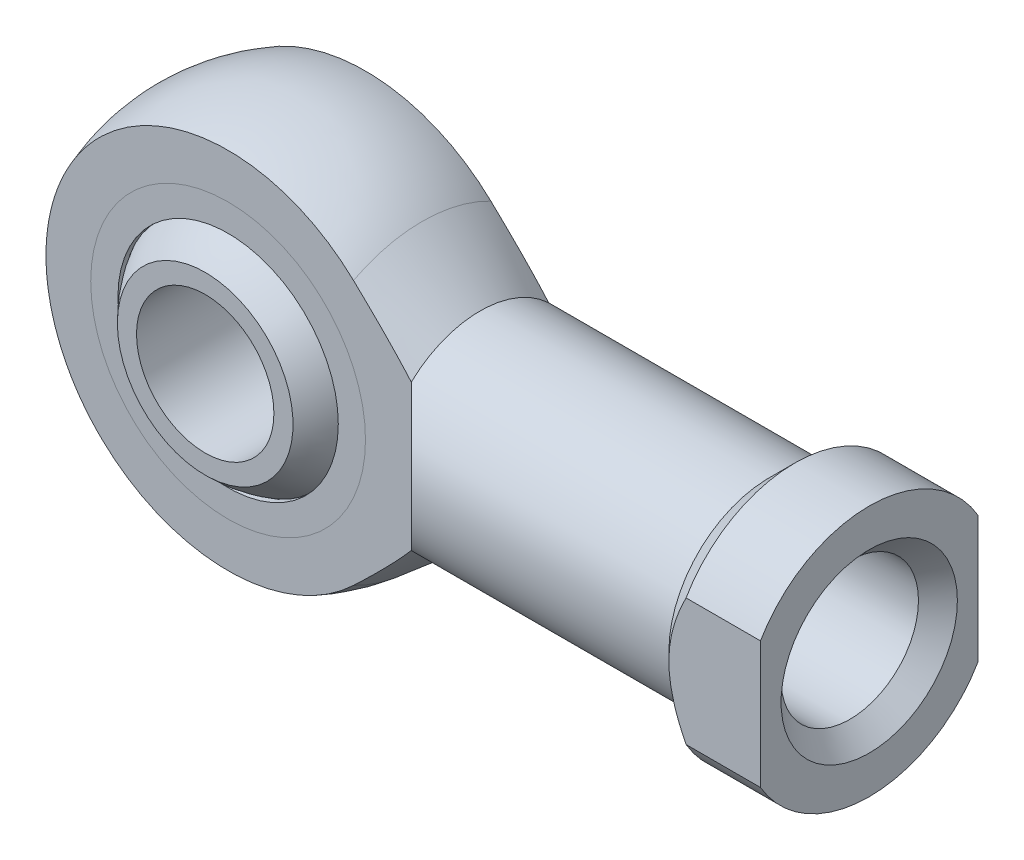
ISO-10303-21;
HEADER;
FILE_DESCRIPTION(('STEP AP214'),'2;1');
FILE_NAME('part.step','',(''),(''),'','','');
FILE_SCHEMA(('AUTOMOTIVE_DESIGN { 1 0 10303 214 1 1 1 1 }'));
ENDSEC;
DATA;
#1=APPLICATION_CONTEXT('core data for automotive mechanical design processes');
#2=APPLICATION_PROTOCOL_DEFINITION('international standard','automotive_design',2000,#1);
#3=PRODUCT_CONTEXT('',#1,'mechanical');
#4=PRODUCT('Part','Part','',(#3));
#5=PRODUCT_RELATED_PRODUCT_CATEGORY('part','',(#4));
#6=PRODUCT_DEFINITION_FORMATION('','',#4);
#7=PRODUCT_DEFINITION_CONTEXT('part definition',#1,'design');
#8=PRODUCT_DEFINITION('design','',#6,#7);
#9=PRODUCT_DEFINITION_SHAPE('','',#8);
#10=(LENGTH_UNIT() NAMED_UNIT(*) SI_UNIT(.MILLI.,.METRE.));
#11=(NAMED_UNIT(*) PLANE_ANGLE_UNIT() SI_UNIT($,.RADIAN.));
#12=(NAMED_UNIT(*) SI_UNIT($,.STERADIAN.) SOLID_ANGLE_UNIT());
#13=UNCERTAINTY_MEASURE_WITH_UNIT(LENGTH_MEASURE(1.E-05),#10,'distance_accuracy_value','');
#14=(GEOMETRIC_REPRESENTATION_CONTEXT(3) GLOBAL_UNCERTAINTY_ASSIGNED_CONTEXT((#13)) GLOBAL_UNIT_ASSIGNED_CONTEXT((#10,
#11,#12)) REPRESENTATION_CONTEXT('',''));
#15=CARTESIAN_POINT('',(0.,0.,0.));
#16=DIRECTION('',(0.,0.,1.));
#17=DIRECTION('',(1.,0.,0.));
#18=AXIS2_PLACEMENT_3D('',#15,#16,#17);
#19=CARTESIAN_POINT('',(0.,0.,0.));
#20=DIRECTION('',(0.,1.,0.));
#21=DIRECTION('',(1.,0.,0.));
#22=AXIS2_PLACEMENT_3D('',#19,#20,#21);
#23=SPHERICAL_SURFACE('',#22,11.085);
#24=CARTESIAN_POINT('',(0.,0.,0.));
#25=DIRECTION('',(0.,0.,-1.));
#26=DIRECTION('',(-1.,0.,0.));
#27=AXIS2_PLACEMENT_3D('',#24,#25,#26);
#28=SPHERICAL_SURFACE('',#27,11.085);
#29=CARTESIAN_POINT('',(0.,0.,8.));
#30=DIRECTION('',(0.,0.,-1.));
#31=DIRECTION('',(-1.,0.,0.));
#32=AXIS2_PLACEMENT_3D('',#29,#30,#31);
#33=CIRCLE('',#32,7.67314961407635);
#34=CARTESIAN_POINT('',(-7.67314961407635,0.,8.));
#35=VERTEX_POINT('',#34);
#36=EDGE_CURVE('P0_E26',#35,#35,#33,.F.);
#37=ORIENTED_EDGE('',*,*,#36,.F.);
#38=EDGE_LOOP('',(#37));
#39=FACE_BOUND('',#38,.T.);
#40=CARTESIAN_POINT('',(0.,0.,-8.));
#41=DIRECTION('',(0.,0.,1.));
#42=DIRECTION('',(1.,0.,0.));
#43=AXIS2_PLACEMENT_3D('',#40,#41,#42);
#44=CIRCLE('',#43,7.67314961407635);
#45=CARTESIAN_POINT('',(7.67314961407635,0.,-8.));
#46=VERTEX_POINT('',#45);
#47=EDGE_CURVE('P0_E10',#46,#46,#44,.F.);
#48=ORIENTED_EDGE('',*,*,#47,.F.);
#49=EDGE_LOOP('',(#48));
#50=FACE_BOUND('',#49,.T.);
#51=ADVANCED_FACE('P0_F14',(#39,#50),#28,.T.);
#52=CARTESIAN_POINT('',(0.,0.,-11.085));
#53=DIRECTION('',(0.,0.,1.));
#54=DIRECTION('',(1.,0.,0.));
#55=AXIS2_PLACEMENT_3D('',#52,#53,#54);
#56=CYLINDRICAL_SURFACE('',#55,6.);
#57=CARTESIAN_POINT('',(0.,0.,8.));
#58=DIRECTION('',(0.,0.,-1.));
#59=DIRECTION('',(-1.,0.,0.));
#60=AXIS2_PLACEMENT_3D('',#57,#58,#59);
#61=CIRCLE('',#60,6.);
#62=CARTESIAN_POINT('',(-6.,0.,8.));
#63=VERTEX_POINT('',#62);
#64=EDGE_CURVE('P0_E17',#63,#63,#61,.F.);
#65=ORIENTED_EDGE('',*,*,#64,.T.);
#66=EDGE_LOOP('',(#65));
#67=FACE_BOUND('',#66,.T.);
#68=CARTESIAN_POINT('',(0.,0.,-8.));
#69=DIRECTION('',(0.,0.,1.));
#70=DIRECTION('',(1.,0.,0.));
#71=AXIS2_PLACEMENT_3D('',#68,#69,#70);
#72=CIRCLE('',#71,6.);
#73=CARTESIAN_POINT('',(6.,0.,-8.));
#74=VERTEX_POINT('',#73);
#75=EDGE_CURVE('P0_E21',#74,#74,#72,.F.);
#76=ORIENTED_EDGE('',*,*,#75,.T.);
#77=EDGE_LOOP('',(#76));
#78=FACE_BOUND('',#77,.T.);
#79=ADVANCED_FACE('P0_F34',(#67,#78),#56,.F.);
#80=CARTESIAN_POINT('',(-11.085,-11.085,-8.));
#81=DIRECTION('',(0.,0.,1.));
#82=DIRECTION('',(1.,0.,0.));
#83=AXIS2_PLACEMENT_3D('',#80,#81,#82);
#84=PLANE('',#83);
#85=ORIENTED_EDGE('',*,*,#47,.T.);
#86=EDGE_LOOP('',(#85));
#87=FACE_BOUND('',#86,.T.);
#88=ORIENTED_EDGE('',*,*,#75,.F.);
#89=EDGE_LOOP('',(#88));
#90=FACE_BOUND('',#89,.T.);
#91=ADVANCED_FACE('P0_F39',(#87,#90),#84,.F.);
#92=CARTESIAN_POINT('',(-11.085,-11.085,8.));
#93=DIRECTION('',(0.,0.,-1.));
#94=DIRECTION('',(-1.,0.,0.));
#95=AXIS2_PLACEMENT_3D('',#92,#93,#94);
#96=PLANE('',#95);
#97=ORIENTED_EDGE('',*,*,#36,.T.);
#98=EDGE_LOOP('',(#97));
#99=FACE_BOUND('',#98,.T.);
#100=ORIENTED_EDGE('',*,*,#64,.F.);
#101=EDGE_LOOP('',(#100));
#102=FACE_BOUND('',#101,.T.);
#103=ADVANCED_FACE('P0_F37',(#99,#102),#96,.F.);
#104=CLOSED_SHELL('',(#51,#79,#91,#103));
#105=MANIFOLD_SOLID_BREP('P0_B1',#104);
#106=CARTESIAN_POINT('',(0.,0.,6.));
#107=DIRECTION('',(0.,0.,1.));
#108=DIRECTION('',(1.,0.,0.));
#109=AXIS2_PLACEMENT_3D('',#106,#107,#108);
#110=PLANE('',#109);
#111=CARTESIAN_POINT('',(0.,0.,6.));
#112=DIRECTION('',(0.,0.,1.));
#113=DIRECTION('',(1.,0.,0.));
#114=AXIS2_PLACEMENT_3D('',#111,#112,#113);
#115=CIRCLE('',#114,12.);
#116=CARTESIAN_POINT('',(12.,0.,6.));
#117=VERTEX_POINT('',#116);
#118=EDGE_CURVE('P1_E10',#117,#117,#115,.T.);
#119=ORIENTED_EDGE('',*,*,#118,.T.);
#120=EDGE_LOOP('',(#119));
#121=FACE_BOUND('',#120,.T.);
#122=CARTESIAN_POINT('',(0.,0.,6.));
#123=DIRECTION('',(0.,0.,1.));
#124=DIRECTION('',(1.,0.,0.));
#125=AXIS2_PLACEMENT_3D('',#122,#123,#124);
#126=CIRCLE('',#125,9.625);
#127=CARTESIAN_POINT('',(9.625,0.,6.));
#128=VERTEX_POINT('',#127);
#129=EDGE_CURVE('P1_E25',#128,#128,#126,.T.);
#130=ORIENTED_EDGE('',*,*,#129,.F.);
#131=EDGE_LOOP('',(#130));
#132=FACE_BOUND('',#131,.T.);
#133=ADVANCED_FACE('P1_F14',(#121,#132),#110,.T.);
#134=CARTESIAN_POINT('',(0.,0.,5.5));
#135=DIRECTION('',(0.,0.,1.));
#136=DIRECTION('',(1.,0.,0.));
#137=AXIS2_PLACEMENT_3D('',#134,#135,#136);
#138=PLANE('',#137);
#139=CARTESIAN_POINT('',(0.,0.,5.5));
#140=DIRECTION('',(0.,0.,1.));
#141=DIRECTION('',(1.,0.,0.));
#142=AXIS2_PLACEMENT_3D('',#139,#140,#141);
#143=CIRCLE('',#142,12.);
#144=CARTESIAN_POINT('',(12.,0.,5.5));
#145=VERTEX_POINT('',#144);
#146=EDGE_CURVE('P1_E18',#145,#145,#143,.T.);
#147=ORIENTED_EDGE('',*,*,#146,.F.);
#148=EDGE_LOOP('',(#147));
#149=FACE_BOUND('',#148,.T.);
#150=CARTESIAN_POINT('',(0.,0.,5.5));
#151=DIRECTION('',(0.,0.,1.));
#152=DIRECTION('',(1.,0.,0.));
#153=AXIS2_PLACEMENT_3D('',#150,#151,#152);
#154=CIRCLE('',#153,9.625);
#155=CARTESIAN_POINT('',(9.625,0.,5.5));
#156=VERTEX_POINT('',#155);
#157=EDGE_CURVE('P1_E27',#156,#156,#154,.T.);
#158=ORIENTED_EDGE('',*,*,#157,.T.);
#159=EDGE_LOOP('',(#158));
#160=FACE_BOUND('',#159,.T.);
#161=ADVANCED_FACE('P1_F37',(#149,#160),#138,.F.);
#162=CARTESIAN_POINT('',(0.,0.,6.));
#163=DIRECTION('',(0.,0.,-1.));
#164=DIRECTION('',(-1.,0.,0.));
#165=AXIS2_PLACEMENT_3D('',#162,#163,#164);
#166=CYLINDRICAL_SURFACE('',#165,12.);
#167=ORIENTED_EDGE('',*,*,#118,.F.);
#168=EDGE_LOOP('',(#167));
#169=FACE_BOUND('',#168,.T.);
#170=ORIENTED_EDGE('',*,*,#146,.T.);
#171=EDGE_LOOP('',(#170));
#172=FACE_BOUND('',#171,.T.);
#173=ADVANCED_FACE('P1_F16',(#169,#172),#166,.T.);
#174=CARTESIAN_POINT('',(0.,0.,6.));
#175=DIRECTION('',(0.,0.,-1.));
#176=DIRECTION('',(-1.,0.,0.));
#177=AXIS2_PLACEMENT_3D('',#174,#175,#176);
#178=CYLINDRICAL_SURFACE('',#177,9.625);
#179=ORIENTED_EDGE('',*,*,#129,.T.);
#180=EDGE_LOOP('',(#179));
#181=FACE_BOUND('',#180,.T.);
#182=ORIENTED_EDGE('',*,*,#157,.F.);
#183=EDGE_LOOP('',(#182));
#184=FACE_BOUND('',#183,.T.);
#185=ADVANCED_FACE('P1_F33',(#181,#184),#178,.F.);
#186=CLOSED_SHELL('',(#133,#161,#173,#185));
#187=MANIFOLD_SOLID_BREP('P1_B1',#186);
#188=CARTESIAN_POINT('',(0.,0.,-5.5));
#189=DIRECTION('',(0.,0.,1.));
#190=DIRECTION('',(1.,0.,0.));
#191=AXIS2_PLACEMENT_3D('',#188,#189,#190);
#192=PLANE('',#191);
#193=CARTESIAN_POINT('',(0.,0.,-5.5));
#194=DIRECTION('',(0.,0.,1.));
#195=DIRECTION('',(1.,0.,0.));
#196=AXIS2_PLACEMENT_3D('',#193,#194,#195);
#197=CIRCLE('',#196,12.);
#198=CARTESIAN_POINT('',(12.,0.,-5.5));
#199=VERTEX_POINT('',#198);
#200=EDGE_CURVE('P2_E10',#199,#199,#197,.T.);
#201=ORIENTED_EDGE('',*,*,#200,.T.);
#202=EDGE_LOOP('',(#201));
#203=FACE_BOUND('',#202,.T.);
#204=CARTESIAN_POINT('',(0.,0.,-5.5));
#205=DIRECTION('',(0.,0.,1.));
#206=DIRECTION('',(1.,0.,0.));
#207=AXIS2_PLACEMENT_3D('',#204,#205,#206);
#208=CIRCLE('',#207,9.625);
#209=CARTESIAN_POINT('',(9.625,0.,-5.5));
#210=VERTEX_POINT('',#209);
#211=EDGE_CURVE('P2_E25',#210,#210,#208,.T.);
#212=ORIENTED_EDGE('',*,*,#211,.F.);
#213=EDGE_LOOP('',(#212));
#214=FACE_BOUND('',#213,.T.);
#215=ADVANCED_FACE('P2_F14',(#203,#214),#192,.T.);
#216=CARTESIAN_POINT('',(0.,0.,-6.));
#217=DIRECTION('',(0.,0.,1.));
#218=DIRECTION('',(1.,0.,0.));
#219=AXIS2_PLACEMENT_3D('',#216,#217,#218);
#220=PLANE('',#219);
#221=CARTESIAN_POINT('',(0.,0.,-6.));
#222=DIRECTION('',(0.,0.,1.));
#223=DIRECTION('',(1.,0.,0.));
#224=AXIS2_PLACEMENT_3D('',#221,#222,#223);
#225=CIRCLE('',#224,12.);
#226=CARTESIAN_POINT('',(12.,0.,-6.));
#227=VERTEX_POINT('',#226);
#228=EDGE_CURVE('P2_E18',#227,#227,#225,.T.);
#229=ORIENTED_EDGE('',*,*,#228,.F.);
#230=EDGE_LOOP('',(#229));
#231=FACE_BOUND('',#230,.T.);
#232=CARTESIAN_POINT('',(0.,0.,-6.));
#233=DIRECTION('',(0.,0.,1.));
#234=DIRECTION('',(1.,0.,0.));
#235=AXIS2_PLACEMENT_3D('',#232,#233,#234);
#236=CIRCLE('',#235,9.625);
#237=CARTESIAN_POINT('',(9.625,0.,-6.));
#238=VERTEX_POINT('',#237);
#239=EDGE_CURVE('P2_E27',#238,#238,#236,.T.);
#240=ORIENTED_EDGE('',*,*,#239,.T.);
#241=EDGE_LOOP('',(#240));
#242=FACE_BOUND('',#241,.T.);
#243=ADVANCED_FACE('P2_F37',(#231,#242),#220,.F.);
#244=CARTESIAN_POINT('',(0.,0.,-5.5));
#245=DIRECTION('',(0.,0.,-1.));
#246=DIRECTION('',(-1.,0.,0.));
#247=AXIS2_PLACEMENT_3D('',#244,#245,#246);
#248=CYLINDRICAL_SURFACE('',#247,12.);
#249=ORIENTED_EDGE('',*,*,#200,.F.);
#250=EDGE_LOOP('',(#249));
#251=FACE_BOUND('',#250,.T.);
#252=ORIENTED_EDGE('',*,*,#228,.T.);
#253=EDGE_LOOP('',(#252));
#254=FACE_BOUND('',#253,.T.);
#255=ADVANCED_FACE('P2_F16',(#251,#254),#248,.T.);
#256=CARTESIAN_POINT('',(0.,0.,-5.5));
#257=DIRECTION('',(0.,0.,-1.));
#258=DIRECTION('',(-1.,0.,0.));
#259=AXIS2_PLACEMENT_3D('',#256,#257,#258);
#260=CYLINDRICAL_SURFACE('',#259,9.625);
#261=ORIENTED_EDGE('',*,*,#211,.T.);
#262=EDGE_LOOP('',(#261));
#263=FACE_BOUND('',#262,.T.);
#264=ORIENTED_EDGE('',*,*,#239,.F.);
#265=EDGE_LOOP('',(#264));
#266=FACE_BOUND('',#265,.T.);
#267=ADVANCED_FACE('P2_F33',(#263,#266),#260,.F.);
#268=CLOSED_SHELL('',(#215,#243,#255,#267));
#269=MANIFOLD_SOLID_BREP('P2_B1',#268);
#270=CARTESIAN_POINT('',(0.,0.,0.));
#271=DIRECTION('',(0.,1.,0.));
#272=DIRECTION('',(1.,0.,0.));
#273=AXIS2_PLACEMENT_3D('',#270,#271,#272);
#274=SPHERICAL_SURFACE('',#273,11.085);
#275=CARTESIAN_POINT('',(0.,0.,0.));
#276=DIRECTION('',(0.,0.,1.));
#277=DIRECTION('',(1.,0.,0.));
#278=AXIS2_PLACEMENT_3D('',#275,#276,#277);
#279=SPHERICAL_SURFACE('',#278,11.085);
#280=CARTESIAN_POINT('',(0.,0.,5.5));
#281=DIRECTION('',(0.,0.,1.));
#282=DIRECTION('',(1.,0.,0.));
#283=AXIS2_PLACEMENT_3D('',#280,#281,#282);
#284=CIRCLE('',#283,9.6243038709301);
#285=CARTESIAN_POINT('',(9.6243038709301,0.,5.5));
#286=VERTEX_POINT('',#285);
#287=EDGE_CURVE('P3_E73',#286,#286,#284,.F.);
#288=ORIENTED_EDGE('',*,*,#287,.F.);
#289=EDGE_LOOP('',(#288));
#290=FACE_BOUND('',#289,.T.);
#291=CARTESIAN_POINT('',(0.,0.,-5.5));
#292=DIRECTION('',(0.,0.,-1.));
#293=DIRECTION('',(-1.,0.,0.));
#294=AXIS2_PLACEMENT_3D('',#291,#292,#293);
#295=CIRCLE('',#294,9.6243038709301);
#296=CARTESIAN_POINT('',(-9.6243038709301,0.,-5.5));
#297=VERTEX_POINT('',#296);
#298=EDGE_CURVE('P3_E20',#297,#297,#295,.F.);
#299=ORIENTED_EDGE('',*,*,#298,.F.);
#300=EDGE_LOOP('',(#299));
#301=FACE_BOUND('',#300,.T.);
#302=ADVANCED_FACE('P3_F16',(#290,#301),#279,.F.);
#303=CARTESIAN_POINT('',(-16.,-17.,-6.));
#304=DIRECTION('',(0.,0.,1.));
#305=DIRECTION('',(1.,0.,0.));
#306=AXIS2_PLACEMENT_3D('',#303,#304,#305);
#307=PLANE('',#306);
#308=CARTESIAN_POINT('',(0.,0.,-6.));
#309=DIRECTION('',(0.,0.,1.));
#310=DIRECTION('',(1.,0.,0.));
#311=AXIS2_PLACEMENT_3D('',#308,#309,#310);
#312=CIRCLE('',#311,15.9059737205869);
#313=CARTESIAN_POINT('',(10.9519919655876,11.5348980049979,-6.));
#314=VERTEX_POINT('',#313);
#315=CARTESIAN_POINT('',(10.9519919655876,-11.5348980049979,-6.));
#316=VERTEX_POINT('',#315);
#317=EDGE_CURVE('P3_E11',#314,#316,#312,.T.);
#318=ORIENTED_EDGE('',*,*,#317,.F.);
#319=CARTESIAN_POINT('',(-32.7884547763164,-49.4833858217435,-6.));
#320=CARTESIAN_POINT('',(-31.8347602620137,-48.6741771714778,-6.));
#321=CARTESIAN_POINT('',(-30.8812049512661,-47.8648044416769,-6.));
#322=CARTESIAN_POINT('',(-28.974424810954,-46.2456693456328,-6.));
#323=CARTESIAN_POINT('',(-28.021199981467,-45.4359069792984,-6.));
#324=CARTESIAN_POINT('',(-25.1619543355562,-43.0058199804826,-6.));
#325=CARTESIAN_POINT('',(-23.2565081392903,-41.3848191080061,-6.));
#326=CARTESIAN_POINT('',(-19.4439820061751,-38.1370821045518,-6.));
#327=CARTESIAN_POINT('',(-17.5369063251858,-36.510340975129,-6.));
#328=CARTESIAN_POINT('',(-14.6787608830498,-34.0674826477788,-6.));
#329=CARTESIAN_POINT('',(-13.7264918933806,-33.2527686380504,-6.));
#330=CARTESIAN_POINT('',(-11.8229549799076,-31.6221721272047,-6.));
#331=CARTESIAN_POINT('',(-10.8716870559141,-30.8062896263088,-6.));
#332=CARTESIAN_POINT('',(-8.95351223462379,-29.1585408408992,-6.));
#333=CARTESIAN_POINT('',(-7.98662793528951,-28.32664824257,-6.));
#334=CARTESIAN_POINT('',(-6.05454821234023,-26.660904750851,-6.));
#335=CARTESIAN_POINT('',(-5.08935278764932,-25.8270538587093,-6.));
#336=CARTESIAN_POINT('',(-3.16097671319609,-24.1565798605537,-6.));
#337=CARTESIAN_POINT('',(-2.19779657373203,-23.3199561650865,-6.));
#338=CARTESIAN_POINT('',(-0.274509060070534,-21.6432180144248,-6.));
#339=CARTESIAN_POINT('',(0.685598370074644,-20.8031036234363,-6.));
#340=CARTESIAN_POINT('',(2.60039592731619,-19.1189500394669,-6.));
#341=CARTESIAN_POINT('',(3.55509105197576,-18.274916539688,-6.));
#342=CARTESIAN_POINT('',(4.98234991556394,-17.0034206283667,-6.));
#343=CARTESIAN_POINT('',(5.4573239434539,-16.5786644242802,-6.));
#344=CARTESIAN_POINT('',(6.40524840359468,-15.7269017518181,-6.));
#345=CARTESIAN_POINT('',(6.87819884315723,-15.2998952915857,-6.));
#346=CARTESIAN_POINT('',(7.82135879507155,-14.4432252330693,-6.));
#347=CARTESIAN_POINT('',(8.29156928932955,-14.0135627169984,-6.));
#348=CARTESIAN_POINT('',(9.22866677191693,-13.1506321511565,-6.));
#349=CARTESIAN_POINT('',(9.69555378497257,-12.717364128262,-6.));
#350=CARTESIAN_POINT('',(10.6248692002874,-11.8461718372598,-6.));
#351=CARTESIAN_POINT('',(11.0872981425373,-11.4082481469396,-6.));
#352=CARTESIAN_POINT('',(11.7763758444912,-10.7466220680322,-6.));
#353=CARTESIAN_POINT('',(12.0053040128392,-10.5252933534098,-6.));
#354=CARTESIAN_POINT('',(12.4613433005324,-10.0807728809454,-6.));
#355=CARTESIAN_POINT('',(12.6884544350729,-9.8575811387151,-6.));
#356=CARTESIAN_POINT('',(13.0702227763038,-9.47873212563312,-6.));
#357=CARTESIAN_POINT('',(13.2254530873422,-9.32365238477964,-6.));
#358=CARTESIAN_POINT('',(13.5347292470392,-9.01231062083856,-6.));
#359=CARTESIAN_POINT('',(13.688775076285,-8.85604857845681,-6.));
#360=CARTESIAN_POINT('',(13.9955176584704,-8.54217471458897,-6.));
#361=CARTESIAN_POINT('',(14.1482142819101,-8.38456276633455,-6.));
#362=CARTESIAN_POINT('',(14.4520188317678,-8.06781888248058,-6.));
#363=CARTESIAN_POINT('',(14.6031267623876,-7.90868695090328,-6.));
#364=CARTESIAN_POINT('',(15.0544219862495,-7.42793291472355,-6.));
#365=CARTESIAN_POINT('',(15.3518514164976,-7.10369454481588,-6.));
#366=CARTESIAN_POINT('',(15.7902028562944,-6.61045174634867,-6.));
#367=CARTESIAN_POINT('',(15.935012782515,-6.44490005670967,-6.));
#368=CARTESIAN_POINT('',(16.2214958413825,-6.11110571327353,-6.));
#369=CARTESIAN_POINT('',(16.3631690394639,-5.942863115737,-6.));
#370=CARTESIAN_POINT('',(16.7071374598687,-5.52499850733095,-6.));
#371=CARTESIAN_POINT('',(16.9072863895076,-5.27359936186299,-6.));
#372=CARTESIAN_POINT('',(17.2967423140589,-4.76227187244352,-6.));
#373=CARTESIAN_POINT('',(17.4860448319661,-4.50234007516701,-6.));
#374=CARTESIAN_POINT('',(17.758244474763,-4.10484162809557,-6.));
#375=CARTESIAN_POINT('',(17.8469231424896,-3.9712338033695,-6.));
#376=CARTESIAN_POINT('',(18.0196860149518,-3.70108846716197,-6.));
#377=CARTESIAN_POINT('',(18.103770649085,-3.56455123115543,-6.));
#378=CARTESIAN_POINT('',(18.2663776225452,-3.2883463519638,-6.));
#379=CARTESIAN_POINT('',(18.3449051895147,-3.14868181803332,-6.));
#380=CARTESIAN_POINT('',(18.4953597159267,-2.86585616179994,-6.));
#381=CARTESIAN_POINT('',(18.5672855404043,-2.72269444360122,-6.));
#382=CARTESIAN_POINT('',(18.7811774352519,-2.2662219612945,-6.));
#383=CARTESIAN_POINT('',(18.9090270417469,-1.94580576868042,-6.));
#384=CARTESIAN_POINT('',(19.0611029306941,-1.45362694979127,-6.));
#385=CARTESIAN_POINT('',(19.1051404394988,-1.28790982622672,-6.));
#386=CARTESIAN_POINT('',(19.178072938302,-0.953208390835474,-6.));
#387=CARTESIAN_POINT('',(19.2069795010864,-0.784226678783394,-6.));
#388=CARTESIAN_POINT('',(19.2398537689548,-0.512402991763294,-6.));
#389=CARTESIAN_POINT('',(19.2491730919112,-0.410185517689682,-6.));
#390=CARTESIAN_POINT('',(19.2616325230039,-0.205316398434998,-6.));
#391=CARTESIAN_POINT('',(19.2647693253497,-0.102664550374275,-6.));
#392=CARTESIAN_POINT('',(19.2647624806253,0.154934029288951,-6.));
#393=CARTESIAN_POINT('',(19.2576081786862,0.309896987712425,-6.));
#394=CARTESIAN_POINT('',(19.2293441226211,0.618593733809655,-6.));
#395=CARTESIAN_POINT('',(19.20822694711,0.772326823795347,-6.));
#396=CARTESIAN_POINT('',(19.1530050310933,1.07765906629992,-6.));
#397=CARTESIAN_POINT('',(19.1188805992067,1.22925462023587,-6.));
#398=CARTESIAN_POINT('',(19.0390719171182,1.52932831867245,-6.));
#399=CARTESIAN_POINT('',(18.9933874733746,1.67780641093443,-6.));
#400=CARTESIAN_POINT('',(18.8604660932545,2.06264879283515,-6.));
#401=CARTESIAN_POINT('',(18.7650646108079,2.29619318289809,-6.));
#402=CARTESIAN_POINT('',(18.5542304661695,2.75407308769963,-6.));
#403=CARTESIAN_POINT('',(18.4387807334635,2.97840055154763,-6.));
#404=CARTESIAN_POINT('',(18.2540806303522,3.30910525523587,-6.));
#405=CARTESIAN_POINT('',(18.1904084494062,3.41865891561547,-6.));
#406=CARTESIAN_POINT('',(18.0597723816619,3.63579123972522,-6.));
#407=CARTESIAN_POINT('',(17.9928084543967,3.74336987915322,-6.));
#408=CARTESIAN_POINT('',(17.8560679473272,3.95664587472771,-6.));
#409=CARTESIAN_POINT('',(17.7862927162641,4.06234409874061,-6.));
#410=CARTESIAN_POINT('',(17.6442690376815,4.27205566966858,-6.));
#411=CARTESIAN_POINT('',(17.572020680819,4.37606907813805,-6.));
#412=CARTESIAN_POINT('',(17.3349745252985,4.70985139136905,-6.));
#413=CARTESIAN_POINT('',(17.1658821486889,4.9365761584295,-6.));
#414=CARTESIAN_POINT('',(16.819655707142,5.38382394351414,-6.));
#415=CARTESIAN_POINT('',(16.6425197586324,5.60434548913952,-6.));
#416=CARTESIAN_POINT('',(16.2819510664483,6.04046702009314,-6.));
#417=CARTESIAN_POINT('',(16.0985132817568,6.25606282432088,-6.));
#418=CARTESIAN_POINT('',(15.7268459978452,6.68303677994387,-6.));
#419=CARTESIAN_POINT('',(15.538616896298,6.89441527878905,-6.));
#420=CARTESIAN_POINT('',(15.1577996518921,7.31428655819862,-6.));
#421=CARTESIAN_POINT('',(14.9652007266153,7.5227695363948,-6.));
#422=CARTESIAN_POINT('',(14.576894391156,7.93682119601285,-6.));
#423=CARTESIAN_POINT('',(14.3811869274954,8.14238982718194,-6.));
#424=CARTESIAN_POINT('',(13.9873183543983,8.55097921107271,-6.));
#425=CARTESIAN_POINT('',(13.7891584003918,8.75400107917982,-6.));
#426=CARTESIAN_POINT('',(13.3907256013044,9.15796257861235,-6.));
#427=CARTESIAN_POINT('',(13.1904527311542,9.35890218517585,-6.));
#428=CARTESIAN_POINT('',(12.5843265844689,9.96171646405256,-6.));
#429=CARTESIAN_POINT('',(12.1757848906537,10.3608881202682,-6.));
#430=CARTESIAN_POINT('',(11.353528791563,11.1539303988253,-6.));
#431=CARTESIAN_POINT('',(10.9398138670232,11.5478004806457,-6.));
#432=CARTESIAN_POINT('',(10.1092873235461,12.3307399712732,-6.));
#433=CARTESIAN_POINT('',(9.69248268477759,12.7198167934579,-6.));
#434=CARTESIAN_POINT('',(8.85594309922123,13.4947714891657,-6.));
#435=CARTESIAN_POINT('',(8.43620826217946,13.8806494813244,-6.));
#436=CARTESIAN_POINT('',(7.59092273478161,14.6530718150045,-6.));
#437=CARTESIAN_POINT('',(7.16535271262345,15.0395949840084,-6.));
#438=CARTESIAN_POINT('',(6.31232948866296,15.8105585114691,-6.));
#439=CARTESIAN_POINT('',(5.8848762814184,16.1949988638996,-6.));
#440=CARTESIAN_POINT('',(4.60023356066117,17.3457918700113,-6.));
#441=CARTESIAN_POINT('',(3.74077132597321,18.109607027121,-6.));
#442=CARTESIAN_POINT('',(2.01766849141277,19.6325992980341,-6.));
#443=CARTESIAN_POINT('',(1.1540276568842,20.3917761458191,-6.));
#444=CARTESIAN_POINT('',(-0.576230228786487,21.9067329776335,-6.));
#445=CARTESIAN_POINT('',(-1.44284728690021,22.6625129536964,-6.));
#446=CARTESIAN_POINT('',(-3.17912451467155,24.1722668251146,-6.));
#447=CARTESIAN_POINT('',(-4.04878681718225,24.9262382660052,-6.));
#448=CARTESIAN_POINT('',(-5.78979694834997,26.4322347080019,-6.));
#449=CARTESIAN_POINT('',(-6.66114477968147,27.1842597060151,-6.));
#450=CARTESIAN_POINT('',(-8.40512477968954,28.686761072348,-6.));
#451=CARTESIAN_POINT('',(-9.27775690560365,29.437237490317,-6.));
#452=CARTESIAN_POINT('',(-11.0240668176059,30.9369729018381,-6.));
#453=CARTESIAN_POINT('',(-11.8977446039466,31.6862318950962,-6.));
#454=CARTESIAN_POINT('',(-14.4367891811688,33.8612308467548,-6.));
#455=CARTESIAN_POINT('',(-16.1032573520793,35.2856849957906,-6.));
#456=CARTESIAN_POINT('',(-19.4383061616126,38.132151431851,-6.));
#457=CARTESIAN_POINT('',(-21.1068868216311,39.5541636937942,-6.));
#458=CARTESIAN_POINT('',(-24.4436700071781,42.3948035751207,-6.));
#459=CARTESIAN_POINT('',(-26.1118708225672,43.8134332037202,-6.));
#460=CARTESIAN_POINT('',(-29.4494014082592,46.6493254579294,-6.));
#461=CARTESIAN_POINT('',(-31.1187311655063,48.0665880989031,-6.));
#462=CARTESIAN_POINT('',(-32.7884547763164,49.4833858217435,-6.));
#463=B_SPLINE_CURVE_WITH_KNOTS('',3,(#319,#320,#321,#322,#323,#324,#325,#326,#327,#328,#329,
#330,#331,#332,#333,#334,#335,#336,#337,#338,#339,#340,#341,#342,#343,#344,#345,#346,#347,#348,
#349,#350,#351,#352,#353,#354,#355,#356,#357,#358,#359,#360,#361,#362,#363,#364,#365,#366,#367,
#368,#369,#370,#371,#372,#373,#374,#375,#376,#377,#378,#379,#380,#381,#382,#383,#384,#385,#386,
#387,#388,#389,#390,#391,#392,#393,#394,#395,#396,#397,#398,#399,#400,#401,#402,#403,#404,#405,
#406,#407,#408,#409,#410,#411,#412,#413,#414,#415,#416,#417,#418,#419,#420,#421,#422,#423,#424,
#425,#426,#427,#428,#429,#430,#431,#432,#433,#434,#435,#436,#437,#438,#439,#440,#441,#442,#443,
#444,#445,#446,#447,#448,#449,#450,#451,#452,#453,#454,#455,#456,#457,#458,#459,#460,#461,#462),
.UNSPECIFIED.,.F.,.F.,(4,2,2,2,2,2,2,2,2,2,2,2,2,2,2,2,2,2,2,2,2,2,2,2,2,2,2,2,2,2,2,2,2,2,2,2,
2,2,2,2,2,2,2,2,2,2,2,2,2,2,2,2,2,2,2,2,2,2,2,2,2,2,2,2,2,2,2,2,2,2,2,4),(0.,3.75222157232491,
7.50444402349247,15.0094624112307,22.5293668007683,26.2890437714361,30.0487200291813,
33.8752301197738,37.7017377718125,41.5291190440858,45.3564302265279,49.1792952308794,
51.0908764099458,53.0024506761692,54.9132915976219,56.8241182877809,58.7347105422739,
59.6899776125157,60.6452366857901,61.3034983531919,61.9617707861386,62.62010572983,
63.2784389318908,64.5982259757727,65.2580405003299,65.9178412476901,66.8816641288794,
67.8458820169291,68.3268827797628,68.8078385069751,69.2883356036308,69.7689151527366,
70.7998394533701,71.3136962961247,71.8271595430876,72.134915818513,72.4428366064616,
72.9075287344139,73.3724680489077,73.8381140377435,74.3037678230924,75.0592568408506,
75.8153923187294,76.195484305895,76.5755809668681,76.9554973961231,77.3353999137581,
78.1836356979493,79.0320711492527,79.881201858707,80.7302623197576,81.5817137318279,
82.4331798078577,83.2842589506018,84.1353482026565,85.8488064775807,87.5624381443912,
89.2729607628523,90.9834196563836,92.7081110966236,94.4328075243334,97.8822424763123,
101.331873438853,104.781512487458,108.23448867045,111.687470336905,115.140339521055,
118.593209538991,125.170110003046,131.747077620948,138.316600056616,144.886047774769),.UNSPECIFIED.);
#464=CARTESIAN_POINT('',(16.,6.3688696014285,-6.));
#465=VERTEX_POINT('',#464);
#466=EDGE_CURVE('P3_E102',#465,#314,#463,.T.);
#467=ORIENTED_EDGE('',*,*,#466,.F.);
#468=DIRECTION('',(0.,1.,0.));
#469=VECTOR('',#468,1.);
#470=CARTESIAN_POINT('',(16.,-17.,-6.));
#471=LINE('',#470,#469);
#472=CARTESIAN_POINT('',(16.,-6.3688696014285,-6.));
#473=VERTEX_POINT('',#472);
#474=EDGE_CURVE('P3_E64',#473,#465,#471,.T.);
#475=ORIENTED_EDGE('',*,*,#474,.F.);
#476=EDGE_CURVE('P3_E33',#316,#473,#463,.T.);
#477=ORIENTED_EDGE('',*,*,#476,.F.);
#478=EDGE_LOOP('',(#318,#467,#475,#477));
#479=FACE_BOUND('',#478,.T.);
#480=CARTESIAN_POINT('',(0.,0.,-6.));
#481=DIRECTION('',(0.,0.,1.));
#482=DIRECTION('',(1.,0.,0.));
#483=AXIS2_PLACEMENT_3D('',#480,#481,#482);
#484=CIRCLE('',#483,12.);
#485=CARTESIAN_POINT('',(12.,0.,-6.));
#486=VERTEX_POINT('',#485);
#487=EDGE_CURVE('P3_E95',#486,#486,#484,.T.);
#488=ORIENTED_EDGE('',*,*,#487,.T.);
#489=EDGE_LOOP('',(#488));
#490=FACE_BOUND('',#489,.T.);
#491=ADVANCED_FACE('P3_F115',(#479,#490),#307,.F.);
#492=CARTESIAN_POINT('',(16.,0.,0.));
#493=DIRECTION('',(-1.,0.,0.));
#494=DIRECTION('',(0.,0.,1.));
#495=AXIS2_PLACEMENT_3D('',#492,#493,#494);
#496=CONICAL_SURFACE('',#495,8.75,0.700022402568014);
#497=CARTESIAN_POINT('',(10.9519919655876,0.,0.));
#498=DIRECTION('',(-1.,0.,0.));
#499=DIRECTION('',(0.,0.,1.));
#500=AXIS2_PLACEMENT_3D('',#497,#498,#499);
#501=CIRCLE('',#500,13.0020718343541);
#502=CARTESIAN_POINT('',(10.9519919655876,-11.5348980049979,6.));
#503=VERTEX_POINT('',#502);
#504=EDGE_CURVE('P3_E79',#316,#503,#501,.T.);
#505=ORIENTED_EDGE('',*,*,#504,.F.);
#506=ORIENTED_EDGE('',*,*,#476,.T.);
#507=CARTESIAN_POINT('',(16.,0.,0.));
#508=DIRECTION('',(-1.,0.,0.));
#509=DIRECTION('',(0.,0.,1.));
#510=AXIS2_PLACEMENT_3D('',#507,#508,#509);
#511=CIRCLE('',#510,8.75);
#512=CARTESIAN_POINT('',(16.,-6.3688696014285,6.));
#513=VERTEX_POINT('',#512);
#514=EDGE_CURVE('P3_E70',#473,#513,#511,.T.);
#515=ORIENTED_EDGE('',*,*,#514,.T.);
#516=CARTESIAN_POINT('',(-32.7884547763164,49.4833858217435,6.));
#517=CARTESIAN_POINT('',(-31.8347602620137,48.6741771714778,6.));
#518=CARTESIAN_POINT('',(-30.8812049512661,47.8648044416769,6.));
#519=CARTESIAN_POINT('',(-28.974424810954,46.2456693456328,6.));
#520=CARTESIAN_POINT('',(-28.021199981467,45.4359069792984,6.));
#521=CARTESIAN_POINT('',(-25.1619543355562,43.0058199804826,6.));
#522=CARTESIAN_POINT('',(-23.2565081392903,41.3848191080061,6.));
#523=CARTESIAN_POINT('',(-19.4439820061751,38.1370821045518,6.));
#524=CARTESIAN_POINT('',(-17.5369063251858,36.510340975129,6.));
#525=CARTESIAN_POINT('',(-14.6787608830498,34.0674826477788,6.));
#526=CARTESIAN_POINT('',(-13.7264918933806,33.2527686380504,6.));
#527=CARTESIAN_POINT('',(-11.8229549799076,31.6221721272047,6.));
#528=CARTESIAN_POINT('',(-10.8716870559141,30.8062896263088,6.));
#529=CARTESIAN_POINT('',(-8.95351223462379,29.1585408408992,6.));
#530=CARTESIAN_POINT('',(-7.98662793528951,28.32664824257,6.));
#531=CARTESIAN_POINT('',(-6.05454821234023,26.660904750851,6.));
#532=CARTESIAN_POINT('',(-5.08935278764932,25.8270538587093,6.));
#533=CARTESIAN_POINT('',(-3.16097671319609,24.1565798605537,6.));
#534=CARTESIAN_POINT('',(-2.19779657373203,23.3199561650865,6.));
#535=CARTESIAN_POINT('',(-0.274509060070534,21.6432180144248,6.));
#536=CARTESIAN_POINT('',(0.685598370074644,20.8031036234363,6.));
#537=CARTESIAN_POINT('',(2.60039592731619,19.1189500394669,6.));
#538=CARTESIAN_POINT('',(3.55509105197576,18.274916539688,6.));
#539=CARTESIAN_POINT('',(4.98234991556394,17.0034206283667,6.));
#540=CARTESIAN_POINT('',(5.4573239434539,16.5786644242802,6.));
#541=CARTESIAN_POINT('',(6.40524840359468,15.7269017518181,6.));
#542=CARTESIAN_POINT('',(6.87819884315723,15.2998952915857,6.));
#543=CARTESIAN_POINT('',(7.82135879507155,14.4432252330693,6.));
#544=CARTESIAN_POINT('',(8.29156928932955,14.0135627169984,6.));
#545=CARTESIAN_POINT('',(9.22866677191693,13.1506321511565,6.));
#546=CARTESIAN_POINT('',(9.69555378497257,12.717364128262,6.));
#547=CARTESIAN_POINT('',(10.6248692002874,11.8461718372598,6.));
#548=CARTESIAN_POINT('',(11.0872981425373,11.4082481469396,6.));
#549=CARTESIAN_POINT('',(11.7763758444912,10.7466220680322,6.));
#550=CARTESIAN_POINT('',(12.0053040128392,10.5252933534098,6.));
#551=CARTESIAN_POINT('',(12.4613433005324,10.0807728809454,6.));
#552=CARTESIAN_POINT('',(12.6884544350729,9.8575811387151,6.));
#553=CARTESIAN_POINT('',(13.0702227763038,9.47873212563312,6.));
#554=CARTESIAN_POINT('',(13.2254530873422,9.32365238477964,6.));
#555=CARTESIAN_POINT('',(13.5347292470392,9.01231062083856,6.));
#556=CARTESIAN_POINT('',(13.688775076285,8.85604857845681,6.));
#557=CARTESIAN_POINT('',(13.9955176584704,8.54217471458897,6.));
#558=CARTESIAN_POINT('',(14.1482142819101,8.38456276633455,6.));
#559=CARTESIAN_POINT('',(14.4520188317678,8.06781888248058,6.));
#560=CARTESIAN_POINT('',(14.6031267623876,7.90868695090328,6.));
#561=CARTESIAN_POINT('',(15.0544219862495,7.42793291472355,6.));
#562=CARTESIAN_POINT('',(15.3518514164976,7.10369454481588,6.));
#563=CARTESIAN_POINT('',(15.7902028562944,6.61045174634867,6.));
#564=CARTESIAN_POINT('',(15.935012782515,6.44490005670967,6.));
#565=CARTESIAN_POINT('',(16.2214958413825,6.11110571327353,6.));
#566=CARTESIAN_POINT('',(16.3631690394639,5.942863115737,6.));
#567=CARTESIAN_POINT('',(16.7071374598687,5.52499850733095,6.));
#568=CARTESIAN_POINT('',(16.9072863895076,5.27359936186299,6.));
#569=CARTESIAN_POINT('',(17.2967423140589,4.76227187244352,6.));
#570=CARTESIAN_POINT('',(17.4860448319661,4.50234007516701,6.));
#571=CARTESIAN_POINT('',(17.758244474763,4.10484162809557,6.));
#572=CARTESIAN_POINT('',(17.8469231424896,3.9712338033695,6.));
#573=CARTESIAN_POINT('',(18.0196860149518,3.70108846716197,6.));
#574=CARTESIAN_POINT('',(18.103770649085,3.56455123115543,6.));
#575=CARTESIAN_POINT('',(18.2663776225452,3.2883463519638,6.));
#576=CARTESIAN_POINT('',(18.3449051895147,3.14868181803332,6.));
#577=CARTESIAN_POINT('',(18.4953597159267,2.86585616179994,6.));
#578=CARTESIAN_POINT('',(18.5672855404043,2.72269444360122,6.));
#579=CARTESIAN_POINT('',(18.7811774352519,2.2662219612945,6.));
#580=CARTESIAN_POINT('',(18.9090270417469,1.94580576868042,6.));
#581=CARTESIAN_POINT('',(19.0611029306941,1.45362694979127,6.));
#582=CARTESIAN_POINT('',(19.1051404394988,1.28790982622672,6.));
#583=CARTESIAN_POINT('',(19.178072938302,0.953208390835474,6.));
#584=CARTESIAN_POINT('',(19.2069795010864,0.784226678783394,6.));
#585=CARTESIAN_POINT('',(19.2398537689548,0.512402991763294,6.));
#586=CARTESIAN_POINT('',(19.2491730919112,0.410185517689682,6.));
#587=CARTESIAN_POINT('',(19.2616325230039,0.205316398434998,6.));
#588=CARTESIAN_POINT('',(19.2647693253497,0.102664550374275,6.));
#589=CARTESIAN_POINT('',(19.2647624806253,-0.154934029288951,6.));
#590=CARTESIAN_POINT('',(19.2576081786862,-0.309896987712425,6.));
#591=CARTESIAN_POINT('',(19.2293441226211,-0.618593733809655,6.));
#592=CARTESIAN_POINT('',(19.20822694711,-0.772326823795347,6.));
#593=CARTESIAN_POINT('',(19.1530050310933,-1.07765906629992,6.));
#594=CARTESIAN_POINT('',(19.1188805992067,-1.22925462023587,6.));
#595=CARTESIAN_POINT('',(19.0390719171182,-1.52932831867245,6.));
#596=CARTESIAN_POINT('',(18.9933874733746,-1.67780641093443,6.));
#597=CARTESIAN_POINT('',(18.8604660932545,-2.06264879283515,6.));
#598=CARTESIAN_POINT('',(18.7650646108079,-2.29619318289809,6.));
#599=CARTESIAN_POINT('',(18.5542304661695,-2.75407308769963,6.));
#600=CARTESIAN_POINT('',(18.4387807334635,-2.97840055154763,6.));
#601=CARTESIAN_POINT('',(18.2540806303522,-3.30910525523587,6.));
#602=CARTESIAN_POINT('',(18.1904084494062,-3.41865891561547,6.));
#603=CARTESIAN_POINT('',(18.0597723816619,-3.63579123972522,6.));
#604=CARTESIAN_POINT('',(17.9928084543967,-3.74336987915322,6.));
#605=CARTESIAN_POINT('',(17.8560679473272,-3.95664587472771,6.));
#606=CARTESIAN_POINT('',(17.7862927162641,-4.06234409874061,6.));
#607=CARTESIAN_POINT('',(17.6442690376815,-4.27205566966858,6.));
#608=CARTESIAN_POINT('',(17.572020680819,-4.37606907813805,6.));
#609=CARTESIAN_POINT('',(17.3349745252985,-4.70985139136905,6.));
#610=CARTESIAN_POINT('',(17.1658821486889,-4.9365761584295,6.));
#611=CARTESIAN_POINT('',(16.819655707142,-5.38382394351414,6.));
#612=CARTESIAN_POINT('',(16.6425197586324,-5.60434548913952,6.));
#613=CARTESIAN_POINT('',(16.2819510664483,-6.04046702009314,6.));
#614=CARTESIAN_POINT('',(16.0985132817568,-6.25606282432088,6.));
#615=CARTESIAN_POINT('',(15.7268459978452,-6.68303677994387,6.));
#616=CARTESIAN_POINT('',(15.538616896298,-6.89441527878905,6.));
#617=CARTESIAN_POINT('',(15.1577996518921,-7.31428655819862,6.));
#618=CARTESIAN_POINT('',(14.9652007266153,-7.5227695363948,6.));
#619=CARTESIAN_POINT('',(14.576894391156,-7.93682119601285,6.));
#620=CARTESIAN_POINT('',(14.3811869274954,-8.14238982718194,6.));
#621=CARTESIAN_POINT('',(13.9873183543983,-8.55097921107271,6.));
#622=CARTESIAN_POINT('',(13.7891584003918,-8.75400107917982,6.));
#623=CARTESIAN_POINT('',(13.3907256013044,-9.15796257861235,6.));
#624=CARTESIAN_POINT('',(13.1904527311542,-9.35890218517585,6.));
#625=CARTESIAN_POINT('',(12.5843265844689,-9.96171646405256,6.));
#626=CARTESIAN_POINT('',(12.1757848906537,-10.3608881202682,6.));
#627=CARTESIAN_POINT('',(11.353528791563,-11.1539303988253,6.));
#628=CARTESIAN_POINT('',(10.9398138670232,-11.5478004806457,6.));
#629=CARTESIAN_POINT('',(10.1092873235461,-12.3307399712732,6.));
#630=CARTESIAN_POINT('',(9.69248268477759,-12.7198167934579,6.));
#631=CARTESIAN_POINT('',(8.85594309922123,-13.4947714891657,6.));
#632=CARTESIAN_POINT('',(8.43620826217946,-13.8806494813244,6.));
#633=CARTESIAN_POINT('',(7.59092273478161,-14.6530718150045,6.));
#634=CARTESIAN_POINT('',(7.16535271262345,-15.0395949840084,6.));
#635=CARTESIAN_POINT('',(6.31232948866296,-15.8105585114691,6.));
#636=CARTESIAN_POINT('',(5.8848762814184,-16.1949988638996,6.));
#637=CARTESIAN_POINT('',(4.60023356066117,-17.3457918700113,6.));
#638=CARTESIAN_POINT('',(3.74077132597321,-18.109607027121,6.));
#639=CARTESIAN_POINT('',(2.01766849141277,-19.6325992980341,6.));
#640=CARTESIAN_POINT('',(1.1540276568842,-20.3917761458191,6.));
#641=CARTESIAN_POINT('',(-0.576230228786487,-21.9067329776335,6.));
#642=CARTESIAN_POINT('',(-1.44284728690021,-22.6625129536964,6.));
#643=CARTESIAN_POINT('',(-3.17912451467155,-24.1722668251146,6.));
#644=CARTESIAN_POINT('',(-4.04878681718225,-24.9262382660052,6.));
#645=CARTESIAN_POINT('',(-5.78979694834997,-26.4322347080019,6.));
#646=CARTESIAN_POINT('',(-6.66114477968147,-27.1842597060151,6.));
#647=CARTESIAN_POINT('',(-8.40512477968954,-28.686761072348,6.));
#648=CARTESIAN_POINT('',(-9.27775690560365,-29.437237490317,6.));
#649=CARTESIAN_POINT('',(-11.0240668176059,-30.9369729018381,6.));
#650=CARTESIAN_POINT('',(-11.8977446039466,-31.6862318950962,6.));
#651=CARTESIAN_POINT('',(-14.4367891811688,-33.8612308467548,6.));
#652=CARTESIAN_POINT('',(-16.1032573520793,-35.2856849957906,6.));
#653=CARTESIAN_POINT('',(-19.4383061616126,-38.132151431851,6.));
#654=CARTESIAN_POINT('',(-21.1068868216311,-39.5541636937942,6.));
#655=CARTESIAN_POINT('',(-24.4436700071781,-42.3948035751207,6.));
#656=CARTESIAN_POINT('',(-26.1118708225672,-43.8134332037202,6.));
#657=CARTESIAN_POINT('',(-29.4494014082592,-46.6493254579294,6.));
#658=CARTESIAN_POINT('',(-31.1187311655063,-48.0665880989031,6.));
#659=CARTESIAN_POINT('',(-32.7884547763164,-49.4833858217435,6.));
#660=B_SPLINE_CURVE_WITH_KNOTS('',3,(#516,#517,#518,#519,#520,#521,#522,#523,#524,#525,#526,
#527,#528,#529,#530,#531,#532,#533,#534,#535,#536,#537,#538,#539,#540,#541,#542,#543,#544,#545,
#546,#547,#548,#549,#550,#551,#552,#553,#554,#555,#556,#557,#558,#559,#560,#561,#562,#563,#564,
#565,#566,#567,#568,#569,#570,#571,#572,#573,#574,#575,#576,#577,#578,#579,#580,#581,#582,#583,
#584,#585,#586,#587,#588,#589,#590,#591,#592,#593,#594,#595,#596,#597,#598,#599,#600,#601,#602,
#603,#604,#605,#606,#607,#608,#609,#610,#611,#612,#613,#614,#615,#616,#617,#618,#619,#620,#621,
#622,#623,#624,#625,#626,#627,#628,#629,#630,#631,#632,#633,#634,#635,#636,#637,#638,#639,#640,
#641,#642,#643,#644,#645,#646,#647,#648,#649,#650,#651,#652,#653,#654,#655,#656,#657,#658,#659),
.UNSPECIFIED.,.F.,.F.,(4,2,2,2,2,2,2,2,2,2,2,2,2,2,2,2,2,2,2,2,2,2,2,2,2,2,2,2,2,2,2,2,2,2,2,2,
2,2,2,2,2,2,2,2,2,2,2,2,2,2,2,2,2,2,2,2,2,2,2,2,2,2,2,2,2,2,2,2,2,2,2,4),(0.,3.75222157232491,
7.50444402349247,15.0094624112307,22.5293668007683,26.2890437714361,30.0487200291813,
33.8752301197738,37.7017377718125,41.5291190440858,45.3564302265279,49.1792952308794,
51.0908764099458,53.0024506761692,54.9132915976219,56.8241182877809,58.7347105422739,
59.6899776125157,60.6452366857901,61.3034983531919,61.9617707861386,62.62010572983,
63.2784389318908,64.5982259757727,65.2580405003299,65.9178412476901,66.8816641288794,
67.8458820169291,68.3268827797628,68.8078385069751,69.2883356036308,69.7689151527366,
70.7998394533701,71.3136962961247,71.8271595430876,72.134915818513,72.4428366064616,
72.9075287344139,73.3724680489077,73.8381140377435,74.3037678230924,75.0592568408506,
75.8153923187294,76.195484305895,76.5755809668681,76.9554973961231,77.3353999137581,
78.1836356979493,79.0320711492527,79.881201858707,80.7302623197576,81.5817137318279,
82.4331798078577,83.2842589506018,84.1353482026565,85.8488064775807,87.5624381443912,
89.2729607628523,90.9834196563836,92.7081110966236,94.4328075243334,97.8822424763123,
101.331873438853,104.781512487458,108.23448867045,111.687470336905,115.140339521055,
118.593209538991,125.170110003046,131.747077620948,138.316600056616,144.886047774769),.UNSPECIFIED.);
#661=EDGE_CURVE('P3_E56',#513,#503,#660,.T.);
#662=ORIENTED_EDGE('',*,*,#661,.T.);
#663=EDGE_LOOP('',(#505,#506,#515,#662));
#664=FACE_BOUND('',#663,.T.);
#665=ADVANCED_FACE('P3_F75',(#664),#496,.T.);
#666=CARTESIAN_POINT('',(16.,0.,0.));
#667=DIRECTION('',(-1.,0.,0.));
#668=DIRECTION('',(0.,0.,1.));
#669=AXIS2_PLACEMENT_3D('',#666,#667,#668);
#670=PLANE('',#669);
#671=ORIENTED_EDGE('',*,*,#514,.F.);
#672=ORIENTED_EDGE('',*,*,#474,.T.);
#673=CARTESIAN_POINT('',(16.,6.3688696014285,6.));
#674=VERTEX_POINT('',#673);
#675=EDGE_CURVE('P3_E72',#674,#465,#511,.T.);
#676=ORIENTED_EDGE('',*,*,#675,.F.);
#677=DIRECTION('',(0.,1.,0.));
#678=VECTOR('',#677,1.);
#679=CARTESIAN_POINT('',(16.,-17.,6.));
#680=LINE('',#679,#678);
#681=EDGE_CURVE('P3_E59',#513,#674,#680,.T.);
#682=ORIENTED_EDGE('',*,*,#681,.F.);
#683=EDGE_LOOP('',(#671,#672,#676,#682));
#684=FACE_BOUND('',#683,.T.);
#685=ADVANCED_FACE('P3_F18',(#684),#670,.F.);
#686=ORIENTED_EDGE('',*,*,#675,.T.);
#687=ORIENTED_EDGE('',*,*,#466,.T.);
#688=CARTESIAN_POINT('',(10.9519919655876,11.5348980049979,6.));
#689=VERTEX_POINT('',#688);
#690=EDGE_CURVE('P3_E76',#689,#314,#501,.T.);
#691=ORIENTED_EDGE('',*,*,#690,.F.);
#692=EDGE_CURVE('P3_E40',#689,#674,#660,.T.);
#693=ORIENTED_EDGE('',*,*,#692,.T.);
#694=EDGE_LOOP('',(#686,#687,#691,#693));
#695=FACE_BOUND('',#694,.T.);
#696=ADVANCED_FACE('P3_F107',(#695),#496,.T.);
#697=CARTESIAN_POINT('',(0.,0.,0.));
#698=DIRECTION('',(-1.,0.,0.));
#699=DIRECTION('',(0.,1.,0.));
#700=AXIS2_PLACEMENT_3D('',#697,#698,#699);
#701=SPHERICAL_SURFACE('',#700,17.);
#702=ORIENTED_EDGE('',*,*,#690,.T.);
#703=ORIENTED_EDGE('',*,*,#317,.T.);
#704=ORIENTED_EDGE('',*,*,#504,.T.);
#705=CARTESIAN_POINT('',(0.,0.,6.));
#706=DIRECTION('',(0.,0.,-1.));
#707=DIRECTION('',(-1.,0.,0.));
#708=AXIS2_PLACEMENT_3D('',#705,#706,#707);
#709=CIRCLE('',#708,15.9059737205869);
#710=EDGE_CURVE('P3_E25',#503,#689,#709,.T.);
#711=ORIENTED_EDGE('',*,*,#710,.T.);
#712=EDGE_LOOP('',(#702,#703,#704,#711));
#713=FACE_BOUND('',#712,.T.);
#714=ADVANCED_FACE('P3_F113',(#713),#701,.T.);
#715=CARTESIAN_POINT('',(-16.,-17.,6.));
#716=DIRECTION('',(0.,0.,-1.));
#717=DIRECTION('',(-1.,0.,0.));
#718=AXIS2_PLACEMENT_3D('',#715,#716,#717);
#719=PLANE('',#718);
#720=CARTESIAN_POINT('',(0.,0.,6.));
#721=DIRECTION('',(0.,0.,1.));
#722=DIRECTION('',(1.,0.,0.));
#723=AXIS2_PLACEMENT_3D('',#720,#721,#722);
#724=CIRCLE('',#723,12.);
#725=CARTESIAN_POINT('',(12.,0.,6.));
#726=VERTEX_POINT('',#725);
#727=EDGE_CURVE('P3_E88',#726,#726,#724,.T.);
#728=ORIENTED_EDGE('',*,*,#727,.F.);
#729=EDGE_LOOP('',(#728));
#730=FACE_BOUND('',#729,.T.);
#731=ORIENTED_EDGE('',*,*,#710,.F.);
#732=ORIENTED_EDGE('',*,*,#661,.F.);
#733=ORIENTED_EDGE('',*,*,#681,.T.);
#734=ORIENTED_EDGE('',*,*,#692,.F.);
#735=EDGE_LOOP('',(#731,#732,#733,#734));
#736=FACE_BOUND('',#735,.T.);
#737=ADVANCED_FACE('P3_F58',(#730,#736),#719,.F.);
#738=CARTESIAN_POINT('',(0.,0.,5.5));
#739=DIRECTION('',(0.,0.,1.));
#740=DIRECTION('',(1.,0.,0.));
#741=AXIS2_PLACEMENT_3D('',#738,#739,#740);
#742=PLANE('',#741);
#743=CARTESIAN_POINT('',(0.,0.,5.5));
#744=DIRECTION('',(0.,0.,1.));
#745=DIRECTION('',(1.,0.,0.));
#746=AXIS2_PLACEMENT_3D('',#743,#744,#745);
#747=CIRCLE('',#746,12.);
#748=CARTESIAN_POINT('',(12.,0.,5.5));
#749=VERTEX_POINT('',#748);
#750=EDGE_CURVE('P3_E84',#749,#749,#747,.T.);
#751=ORIENTED_EDGE('',*,*,#750,.T.);
#752=EDGE_LOOP('',(#751));
#753=FACE_BOUND('',#752,.T.);
#754=ORIENTED_EDGE('',*,*,#287,.T.);
#755=EDGE_LOOP('',(#754));
#756=FACE_BOUND('',#755,.T.);
#757=ADVANCED_FACE('P3_F112',(#753,#756),#742,.T.);
#758=CARTESIAN_POINT('',(0.,0.,5.5));
#759=DIRECTION('',(0.,0.,1.));
#760=DIRECTION('',(1.,0.,0.));
#761=AXIS2_PLACEMENT_3D('',#758,#759,#760);
#762=CYLINDRICAL_SURFACE('',#761,12.);
#763=ORIENTED_EDGE('',*,*,#750,.F.);
#764=EDGE_LOOP('',(#763));
#765=FACE_BOUND('',#764,.T.);
#766=ORIENTED_EDGE('',*,*,#727,.T.);
#767=EDGE_LOOP('',(#766));
#768=FACE_BOUND('',#767,.T.);
#769=ADVANCED_FACE('P3_F134',(#765,#768),#762,.F.);
#770=CARTESIAN_POINT('',(0.,0.,-5.5));
#771=DIRECTION('',(0.,0.,-1.));
#772=DIRECTION('',(1.,0.,0.));
#773=AXIS2_PLACEMENT_3D('',#770,#771,#772);
#774=PLANE('',#773);
#775=CARTESIAN_POINT('',(0.,0.,-5.5));
#776=DIRECTION('',(0.,0.,1.));
#777=DIRECTION('',(1.,0.,0.));
#778=AXIS2_PLACEMENT_3D('',#775,#776,#777);
#779=CIRCLE('',#778,12.);
#780=CARTESIAN_POINT('',(12.,0.,-5.5));
#781=VERTEX_POINT('',#780);
#782=EDGE_CURVE('P3_E153',#781,#781,#779,.T.);
#783=ORIENTED_EDGE('',*,*,#782,.F.);
#784=EDGE_LOOP('',(#783));
#785=FACE_BOUND('',#784,.T.);
#786=ORIENTED_EDGE('',*,*,#298,.T.);
#787=EDGE_LOOP('',(#786));
#788=FACE_BOUND('',#787,.T.);
#789=ADVANCED_FACE('P3_F137',(#785,#788),#774,.T.);
#790=CARTESIAN_POINT('',(0.,0.,-5.5));
#791=DIRECTION('',(0.,0.,-1.));
#792=DIRECTION('',(-1.,0.,0.));
#793=AXIS2_PLACEMENT_3D('',#790,#791,#792);
#794=CYLINDRICAL_SURFACE('',#793,12.);
#795=ORIENTED_EDGE('',*,*,#782,.T.);
#796=EDGE_LOOP('',(#795));
#797=FACE_BOUND('',#796,.T.);
#798=ORIENTED_EDGE('',*,*,#487,.F.);
#799=EDGE_LOOP('',(#798));
#800=FACE_BOUND('',#799,.T.);
#801=ADVANCED_FACE('P3_F141',(#797,#800),#794,.F.);
#802=CLOSED_SHELL('',(#302,#491,#665,#685,#696,#714,#737,#757,#769,#789,#801));
#803=MANIFOLD_SOLID_BREP('P3_B1',#802);
#804=CARTESIAN_POINT('',(16.,0.,0.));
#805=DIRECTION('',(-1.,0.,0.));
#806=DIRECTION('',(0.,0.,1.));
#807=AXIS2_PLACEMENT_3D('',#804,#805,#806);
#808=CYLINDRICAL_SURFACE('',#807,11.);
#809=CARTESIAN_POINT('',(50.,0.,0.));
#810=DIRECTION('',(-1.,0.,0.));
#811=DIRECTION('',(0.,0.,1.));
#812=AXIS2_PLACEMENT_3D('',#809,#810,#811);
#813=CIRCLE('',#812,11.);
#814=CARTESIAN_POINT('',(50.,5.54526825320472,9.5));
#815=VERTEX_POINT('',#814);
#816=CARTESIAN_POINT('',(50.,5.54526825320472,-9.5));
#817=VERTEX_POINT('',#816);
#818=EDGE_CURVE('P4_E86',#815,#817,#813,.T.);
#819=ORIENTED_EDGE('',*,*,#818,.T.);
#820=DIRECTION('',(-1.,0.,0.));
#821=VECTOR('',#820,1.);
#822=CARTESIAN_POINT('',(16.,5.54526825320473,-9.5));
#823=LINE('',#822,#821);
#824=CARTESIAN_POINT('',(43.5,5.54526825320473,-9.5));
#825=VERTEX_POINT('',#824);
#826=EDGE_CURVE('P4_E70',#817,#825,#823,.T.);
#827=ORIENTED_EDGE('',*,*,#826,.T.);
#828=CARTESIAN_POINT('',(43.5,0.,0.));
#829=DIRECTION('',(-1.,0.,0.));
#830=DIRECTION('',(0.,0.,1.));
#831=AXIS2_PLACEMENT_3D('',#828,#829,#830);
#832=CIRCLE('',#831,11.);
#833=CARTESIAN_POINT('',(43.5,5.54526825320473,9.5));
#834=VERTEX_POINT('',#833);
#835=EDGE_CURVE('P4_E94',#834,#825,#832,.T.);
#836=ORIENTED_EDGE('',*,*,#835,.F.);
#837=DIRECTION('',(-1.,0.,0.));
#838=VECTOR('',#837,1.);
#839=CARTESIAN_POINT('',(16.,5.54526825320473,9.5));
#840=LINE('',#839,#838);
#841=EDGE_CURVE('P4_E38',#834,#815,#840,.F.);
#842=ORIENTED_EDGE('',*,*,#841,.T.);
#843=EDGE_LOOP('',(#819,#827,#836,#842));
#844=FACE_BOUND('',#843,.T.);
#845=ADVANCED_FACE('P4_F15',(#844),#808,.T.);
#846=CARTESIAN_POINT('',(50.,0.,0.));
#847=DIRECTION('',(1.,0.,0.));
#848=DIRECTION('',(0.,0.,-1.));
#849=AXIS2_PLACEMENT_3D('',#846,#847,#848);
#850=PLANE('',#849);
#851=CARTESIAN_POINT('',(50.,0.,0.));
#852=DIRECTION('',(1.,0.,0.));
#853=DIRECTION('',(0.,0.,-1.));
#854=AXIS2_PLACEMENT_3D('',#851,#852,#853);
#855=CIRCLE('',#854,7.70000000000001);
#856=CARTESIAN_POINT('',(50.,0.,-7.70000000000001));
#857=VERTEX_POINT('',#856);
#858=EDGE_CURVE('P4_E10',#857,#857,#855,.F.);
#859=ORIENTED_EDGE('',*,*,#858,.T.);
#860=EDGE_LOOP('',(#859));
#861=FACE_BOUND('',#860,.T.);
#862=DIRECTION('',(0.,-1.,0.));
#863=VECTOR('',#862,1.);
#864=CARTESIAN_POINT('',(50.,-11.,-9.5));
#865=LINE('',#864,#863);
#866=CARTESIAN_POINT('',(50.,-5.54526825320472,-9.5));
#867=VERTEX_POINT('',#866);
#868=EDGE_CURVE('P4_E73',#817,#867,#865,.T.);
#869=ORIENTED_EDGE('',*,*,#868,.F.);
#870=ORIENTED_EDGE('',*,*,#818,.F.);
#871=DIRECTION('',(0.,1.,0.));
#872=VECTOR('',#871,1.);
#873=CARTESIAN_POINT('',(50.,-11.,9.5));
#874=LINE('',#873,#872);
#875=CARTESIAN_POINT('',(50.,-5.54526825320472,9.5));
#876=VERTEX_POINT('',#875);
#877=EDGE_CURVE('P4_E79',#876,#815,#874,.T.);
#878=ORIENTED_EDGE('',*,*,#877,.F.);
#879=EDGE_CURVE('P4_E87',#867,#876,#813,.T.);
#880=ORIENTED_EDGE('',*,*,#879,.F.);
#881=EDGE_LOOP('',(#869,#870,#878,#880));
#882=FACE_BOUND('',#881,.T.);
#883=ADVANCED_FACE('P4_F84',(#861,#882),#850,.T.);
#884=CARTESIAN_POINT('',(28.,0.,0.));
#885=DIRECTION('',(1.,0.,0.));
#886=DIRECTION('',(0.,0.,-1.));
#887=AXIS2_PLACEMENT_3D('',#884,#885,#886);
#888=PLANE('',#887);
#889=CARTESIAN_POINT('',(28.,0.,0.));
#890=DIRECTION('',(1.,0.,0.));
#891=DIRECTION('',(0.,0.,-1.));
#892=AXIS2_PLACEMENT_3D('',#889,#890,#891);
#893=CIRCLE('',#892,6.);
#894=CARTESIAN_POINT('',(28.,0.,-6.));
#895=VERTEX_POINT('',#894);
#896=EDGE_CURVE('P4_E92',#895,#895,#893,.T.);
#897=ORIENTED_EDGE('',*,*,#896,.T.);
#898=EDGE_LOOP('',(#897));
#899=FACE_BOUND('',#898,.T.);
#900=CARTESIAN_POINT('',(28.,0.,0.));
#901=DIRECTION('',(1.,0.,0.));
#902=DIRECTION('',(0.,0.,-1.));
#903=AXIS2_PLACEMENT_3D('',#900,#901,#902);
#904=CIRCLE('',#903,5.1);
#905=CARTESIAN_POINT('',(28.,0.,-5.1));
#906=VERTEX_POINT('',#905);
#907=EDGE_CURVE('P4_E100',#906,#906,#904,.F.);
#908=ORIENTED_EDGE('',*,*,#907,.T.);
#909=EDGE_LOOP('',(#908));
#910=FACE_BOUND('',#909,.T.);
#911=ADVANCED_FACE('P4_F149',(#899,#910),#888,.T.);
#912=CARTESIAN_POINT('',(28.,0.,0.));
#913=DIRECTION('',(1.,0.,0.));
#914=DIRECTION('',(0.,0.,-1.));
#915=AXIS2_PLACEMENT_3D('',#912,#913,#914);
#916=CYLINDRICAL_SURFACE('',#915,6.);
#917=CARTESIAN_POINT('',(48.3,0.,0.));
#918=DIRECTION('',(1.,0.,0.));
#919=DIRECTION('',(0.,0.,-1.));
#920=AXIS2_PLACEMENT_3D('',#917,#918,#919);
#921=CIRCLE('',#920,6.);
#922=CARTESIAN_POINT('',(48.3,0.,-6.));
#923=VERTEX_POINT('',#922);
#924=EDGE_CURVE('P4_E23',#923,#923,#921,.T.);
#925=ORIENTED_EDGE('',*,*,#924,.T.);
#926=EDGE_LOOP('',(#925));
#927=FACE_BOUND('',#926,.T.);
#928=ORIENTED_EDGE('',*,*,#896,.F.);
#929=EDGE_LOOP('',(#928));
#930=FACE_BOUND('',#929,.T.);
#931=ADVANCED_FACE('P4_F182',(#927,#930),#916,.F.);
#932=CARTESIAN_POINT('',(25.,0.,0.));
#933=DIRECTION('',(1.,0.,0.));
#934=DIRECTION('',(0.,0.,-1.));
#935=AXIS2_PLACEMENT_3D('',#932,#933,#934);
#936=CYLINDRICAL_SURFACE('',#935,5.1);
#937=CARTESIAN_POINT('',(25.,0.,0.));
#938=DIRECTION('',(-1.,0.,0.));
#939=DIRECTION('',(0.,0.,1.));
#940=AXIS2_PLACEMENT_3D('',#937,#938,#939);
#941=CIRCLE('',#940,5.1);
#942=CARTESIAN_POINT('',(25.,0.,5.1));
#943=VERTEX_POINT('',#942);
#944=EDGE_CURVE('P4_E89',#943,#943,#941,.T.);
#945=ORIENTED_EDGE('',*,*,#944,.T.);
#946=EDGE_LOOP('',(#945));
#947=FACE_BOUND('',#946,.T.);
#948=ORIENTED_EDGE('',*,*,#907,.F.);
#949=EDGE_LOOP('',(#948));
#950=FACE_BOUND('',#949,.T.);
#951=ADVANCED_FACE('P4_F163',(#947,#950),#936,.F.);
#952=CARTESIAN_POINT('',(25.,0.,0.));
#953=DIRECTION('',(1.,0.,0.));
#954=DIRECTION('',(0.,0.,-1.));
#955=AXIS2_PLACEMENT_3D('',#952,#953,#954);
#956=CONICAL_SURFACE('',#955,5.1,1.0471975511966);
#957=CARTESIAN_POINT('',(22.055513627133,0.,0.));
#958=VERTEX_POINT('',#957);
#959=VERTEX_LOOP('',#958);
#960=FACE_BOUND('',#959,.T.);
#961=ORIENTED_EDGE('',*,*,#944,.F.);
#962=EDGE_LOOP('',(#961));
#963=FACE_BOUND('',#962,.T.);
#964=ADVANCED_FACE('P4_F154',(#960,#963),#956,.F.);
#965=CARTESIAN_POINT('',(43.5,-5.54526825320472,-9.5));
#966=VERTEX_POINT('',#965);
#967=CARTESIAN_POINT('',(43.5,-5.54526825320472,9.5));
#968=VERTEX_POINT('',#967);
#969=EDGE_CURVE('P4_E167',#966,#968,#832,.T.);
#970=ORIENTED_EDGE('',*,*,#969,.F.);
#971=DIRECTION('',(-1.,0.,0.));
#972=VECTOR('',#971,1.);
#973=CARTESIAN_POINT('',(16.,-5.54526825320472,-9.5));
#974=LINE('',#973,#972);
#975=EDGE_CURVE('P4_E30',#966,#867,#974,.F.);
#976=ORIENTED_EDGE('',*,*,#975,.T.);
#977=ORIENTED_EDGE('',*,*,#879,.T.);
#978=DIRECTION('',(-1.,0.,0.));
#979=VECTOR('',#978,1.);
#980=CARTESIAN_POINT('',(16.,-5.54526825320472,9.5));
#981=LINE('',#980,#979);
#982=EDGE_CURVE('P4_E169',#876,#968,#981,.T.);
#983=ORIENTED_EDGE('',*,*,#982,.T.);
#984=EDGE_LOOP('',(#970,#976,#977,#983));
#985=FACE_BOUND('',#984,.T.);
#986=ADVANCED_FACE('P4_F144',(#985),#808,.T.);
#987=CARTESIAN_POINT('',(43.5,0.,0.));
#988=DIRECTION('',(1.,0.,0.));
#989=DIRECTION('',(0.,0.,-1.));
#990=AXIS2_PLACEMENT_3D('',#987,#988,#989);
#991=CONICAL_SURFACE('',#990,11.,0.785398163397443);
#992=CARTESIAN_POINT('',(41.25,0.,0.));
#993=DIRECTION('',(-1.,0.,0.));
#994=DIRECTION('',(0.,0.,1.));
#995=AXIS2_PLACEMENT_3D('',#992,#993,#994);
#996=CIRCLE('',#995,8.75);
#997=CARTESIAN_POINT('',(41.25,0.,8.75));
#998=VERTEX_POINT('',#997);
#999=EDGE_CURVE('P4_E171',#998,#998,#996,.T.);
#1000=ORIENTED_EDGE('',*,*,#999,.F.);
#1001=EDGE_LOOP('',(#1000));
#1002=FACE_BOUND('',#1001,.T.);
#1003=ORIENTED_EDGE('',*,*,#835,.T.);
#1004=CARTESIAN_POINT('',(52.8413939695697,-17.9867259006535,-9.5));
#1005=CARTESIAN_POINT('',(52.4700065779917,-17.5666496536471,-9.5));
#1006=CARTESIAN_POINT('',(52.1001385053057,-17.145216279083,-9.5));
#1007=CARTESIAN_POINT('',(51.3642567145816,-16.2989117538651,-9.5));
#1008=CARTESIAN_POINT('',(50.9982434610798,-15.8740401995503,-9.5));
#1009=CARTESIAN_POINT('',(50.2691839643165,-15.0181318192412,-9.5));
#1010=CARTESIAN_POINT('',(49.9061612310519,-14.5870749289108,-9.5));
#1011=CARTESIAN_POINT('',(49.186181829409,-13.7199534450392,-9.5));
#1012=CARTESIAN_POINT('',(48.8292248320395,-13.2838891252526,-9.5));
#1013=CARTESIAN_POINT('',(48.0997595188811,-12.3765930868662,-9.5));
#1014=CARTESIAN_POINT('',(47.7277767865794,-11.9049377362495,-9.5));
#1015=CARTESIAN_POINT('',(46.9953606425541,-10.9525533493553,-9.5));
#1016=CARTESIAN_POINT('',(46.6349291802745,-10.4718228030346,-9.5));
#1017=CARTESIAN_POINT('',(46.1066026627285,-9.74255839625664,-9.5));
#1018=CARTESIAN_POINT('',(45.9327182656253,-9.49836189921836,-9.5));
#1019=CARTESIAN_POINT('',(45.5896637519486,-9.00668465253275,-9.5));
#1020=CARTESIAN_POINT('',(45.420493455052,-8.75920402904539,-9.5));
#1021=CARTESIAN_POINT('',(45.0877997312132,-8.26057920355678,-9.5));
#1022=CARTESIAN_POINT('',(44.924274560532,-8.00943616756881,-9.5));
#1023=CARTESIAN_POINT('',(44.603936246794,-7.50291779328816,-9.5));
#1024=CARTESIAN_POINT('',(44.4471225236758,-7.24754282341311,-9.5));
#1025=CARTESIAN_POINT('',(44.1895825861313,-6.81297287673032,-9.5));
#1026=CARTESIAN_POINT('',(44.0867127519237,-6.63504954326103,-9.5));
#1027=CARTESIAN_POINT('',(43.8853304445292,-6.27675779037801,-9.5));
#1028=CARTESIAN_POINT('',(43.7868179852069,-6.09638936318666,-9.5));
#1029=CARTESIAN_POINT('',(43.4986590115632,-5.55120590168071,-9.5));
#1030=CARTESIAN_POINT('',(43.3164382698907,-5.18239155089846,-9.5));
#1031=CARTESIAN_POINT('',(42.9796738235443,-4.43656898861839,-9.5));
#1032=CARTESIAN_POINT('',(42.8248758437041,-4.05967684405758,-9.5));
#1033=CARTESIAN_POINT('',(42.5485001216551,-3.29385623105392,-9.5));
#1034=CARTESIAN_POINT('',(42.4269019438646,-2.90493533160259,-9.5));
#1035=CARTESIAN_POINT('',(42.2555046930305,-2.23413748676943,-9.5));
#1036=CARTESIAN_POINT('',(42.1951083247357,-1.95497195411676,-9.5));
#1037=CARTESIAN_POINT('',(42.0975371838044,-1.39258995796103,-9.5));
#1038=CARTESIAN_POINT('',(42.0603581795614,-1.10937424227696,-9.5));
#1039=CARTESIAN_POINT('',(42.0112259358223,-0.541480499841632,-9.5));
#1040=CARTESIAN_POINT('',(41.9992068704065,-0.256808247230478,-9.5));
#1041=CARTESIAN_POINT('',(42.0008746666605,0.312471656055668,-9.5));
#1042=CARTESIAN_POINT('',(42.0145624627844,0.597079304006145,-9.5));
#1043=CARTESIAN_POINT('',(42.0666932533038,1.16198944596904,-9.5));
#1044=CARTESIAN_POINT('',(42.1049639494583,1.44230810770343,-9.5));
#1045=CARTESIAN_POINT('',(42.2041472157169,1.99887976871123,-9.5));
#1046=CARTESIAN_POINT('',(42.2650619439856,2.27513237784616,-9.5));
#1047=CARTESIAN_POINT('',(42.4076268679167,2.82532782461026,-9.5));
#1048=CARTESIAN_POINT('',(42.4894918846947,3.09921435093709,-9.5));
#1049=CARTESIAN_POINT('',(42.6706398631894,3.6410313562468,-9.5));
#1050=CARTESIAN_POINT('',(42.7699192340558,3.90896305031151,-9.5));
#1051=CARTESIAN_POINT('',(43.0319187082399,4.56032920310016,-9.5));
#1052=CARTESIAN_POINT('',(43.2028658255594,4.94044448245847,-9.5));
#1053=CARTESIAN_POINT('',(43.5684371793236,5.6892137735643,-9.5));
#1054=CARTESIAN_POINT('',(43.7630767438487,6.05786016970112,-9.5));
#1055=CARTESIAN_POINT('',(44.1710855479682,6.78643043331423,-9.5));
#1056=CARTESIAN_POINT('',(44.3845242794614,7.14631507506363,-9.5));
#1057=CARTESIAN_POINT('',(44.825191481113,7.8573623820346,-9.5));
#1058=CARTESIAN_POINT('',(45.0524167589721,8.2085270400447,-9.5));
#1059=CARTESIAN_POINT('',(45.5051797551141,8.8850663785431,-9.5));
#1060=CARTESIAN_POINT('',(45.7301591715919,9.21081663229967,-9.5));
#1061=CARTESIAN_POINT('',(46.1878162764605,9.85688910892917,-9.5));
#1062=CARTESIAN_POINT('',(46.4204946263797,10.1772108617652,-9.5));
#1063=CARTESIAN_POINT('',(46.8898621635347,10.8103164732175,-9.5));
#1064=CARTESIAN_POINT('',(47.1264945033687,11.1231426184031,-9.5));
#1065=CARTESIAN_POINT('',(47.6047221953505,11.7448535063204,-9.5));
#1066=CARTESIAN_POINT('',(47.8463162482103,12.0537392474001,-9.5));
#1067=CARTESIAN_POINT('',(48.0898975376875,12.3610236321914,-9.5));
#1068=B_SPLINE_CURVE_WITH_KNOTS('',3,(#1004,#1005,#1006,#1007,#1008,#1009,#1010,#1011,#1012,
#1013,#1014,#1015,#1016,#1017,#1018,#1019,#1020,#1021,#1022,#1023,#1024,#1025,#1026,#1027,#1028,
#1029,#1030,#1031,#1032,#1033,#1034,#1035,#1036,#1037,#1038,#1039,#1040,#1041,#1042,#1043,#1044,
#1045,#1046,#1047,#1048,#1049,#1050,#1051,#1052,#1053,#1054,#1055,#1056,#1057,#1058,#1059,#1060,
#1061,#1062,#1063,#1064,#1065,#1066,#1067),.UNSPECIFIED.,.F.,.F.,(4,2,2,2,2,2,2,2,2,2,2,2,2,2,2,
2,2,2,2,2,2,2,2,2,2,2,2,2,2,2,2,4),(0.,1.682133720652,3.36446788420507,5.05509255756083,
6.74562524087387,8.54757577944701,10.3498288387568,11.2491238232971,12.1483843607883,
13.0473645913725,13.9462669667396,14.5627730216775,15.1792810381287,16.412572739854,
17.6337505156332,18.8541749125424,19.7102021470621,20.5660733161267,21.4197024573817,
22.2733626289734,23.1211039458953,23.9689260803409,24.8258166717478,25.682530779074,
26.9317321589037,28.1817460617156,29.4365919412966,30.6911483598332,31.8786853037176,
33.0663245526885,34.2430012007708,35.4193735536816),.UNSPECIFIED.);
#1069=EDGE_CURVE('P4_E74',#825,#966,#1068,.F.);
#1070=ORIENTED_EDGE('',*,*,#1069,.T.);
#1071=ORIENTED_EDGE('',*,*,#969,.T.);
#1072=CARTESIAN_POINT('',(52.8413939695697,-17.9867259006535,9.5));
#1073=CARTESIAN_POINT('',(52.4700065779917,-17.5666496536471,9.5));
#1074=CARTESIAN_POINT('',(52.1001385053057,-17.145216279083,9.5));
#1075=CARTESIAN_POINT('',(51.3642567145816,-16.2989117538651,9.5));
#1076=CARTESIAN_POINT('',(50.9982434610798,-15.8740401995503,9.5));
#1077=CARTESIAN_POINT('',(50.2691839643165,-15.0181318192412,9.5));
#1078=CARTESIAN_POINT('',(49.9061612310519,-14.5870749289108,9.5));
#1079=CARTESIAN_POINT('',(49.186181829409,-13.7199534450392,9.5));
#1080=CARTESIAN_POINT('',(48.8292248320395,-13.2838891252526,9.5));
#1081=CARTESIAN_POINT('',(48.0997595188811,-12.3765930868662,9.5));
#1082=CARTESIAN_POINT('',(47.7277767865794,-11.9049377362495,9.5));
#1083=CARTESIAN_POINT('',(46.9953606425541,-10.9525533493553,9.5));
#1084=CARTESIAN_POINT('',(46.6349291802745,-10.4718228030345,9.5));
#1085=CARTESIAN_POINT('',(46.1066026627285,-9.74255839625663,9.5));
#1086=CARTESIAN_POINT('',(45.9327182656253,-9.49836189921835,9.5));
#1087=CARTESIAN_POINT('',(45.5896637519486,-9.00668465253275,9.5));
#1088=CARTESIAN_POINT('',(45.420493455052,-8.75920402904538,9.5));
#1089=CARTESIAN_POINT('',(45.0877997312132,-8.26057920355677,9.5));
#1090=CARTESIAN_POINT('',(44.924274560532,-8.0094361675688,9.5));
#1091=CARTESIAN_POINT('',(44.603936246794,-7.50291779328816,9.5));
#1092=CARTESIAN_POINT('',(44.4471225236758,-7.24754282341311,9.5));
#1093=CARTESIAN_POINT('',(44.1895825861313,-6.81297287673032,9.5));
#1094=CARTESIAN_POINT('',(44.0867127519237,-6.63504954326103,9.5));
#1095=CARTESIAN_POINT('',(43.8853304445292,-6.27675779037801,9.5));
#1096=CARTESIAN_POINT('',(43.7868179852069,-6.09638936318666,9.5));
#1097=CARTESIAN_POINT('',(43.4986590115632,-5.55120590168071,9.5));
#1098=CARTESIAN_POINT('',(43.3164382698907,-5.18239155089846,9.5));
#1099=CARTESIAN_POINT('',(42.9796738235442,-4.43656898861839,9.5));
#1100=CARTESIAN_POINT('',(42.8248758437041,-4.05967684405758,9.5));
#1101=CARTESIAN_POINT('',(42.5485001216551,-3.29385623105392,9.5));
#1102=CARTESIAN_POINT('',(42.4269019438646,-2.90493533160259,9.5));
#1103=CARTESIAN_POINT('',(42.2555046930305,-2.23413748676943,9.5));
#1104=CARTESIAN_POINT('',(42.1951083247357,-1.95497195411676,9.5));
#1105=CARTESIAN_POINT('',(42.0975371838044,-1.39258995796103,9.5));
#1106=CARTESIAN_POINT('',(42.0603581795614,-1.10937424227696,9.5));
#1107=CARTESIAN_POINT('',(42.0112259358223,-0.541480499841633,9.5));
#1108=CARTESIAN_POINT('',(41.9992068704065,-0.256808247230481,9.5));
#1109=CARTESIAN_POINT('',(42.0008746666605,0.312471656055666,9.5));
#1110=CARTESIAN_POINT('',(42.0145624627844,0.597079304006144,9.5));
#1111=CARTESIAN_POINT('',(42.0666932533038,1.16198944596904,9.5));
#1112=CARTESIAN_POINT('',(42.1049639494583,1.44230810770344,9.5));
#1113=CARTESIAN_POINT('',(42.2041472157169,1.99887976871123,9.5));
#1114=CARTESIAN_POINT('',(42.2650619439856,2.27513237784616,9.5));
#1115=CARTESIAN_POINT('',(42.4076268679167,2.82532782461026,9.5));
#1116=CARTESIAN_POINT('',(42.4894918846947,3.09921435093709,9.5));
#1117=CARTESIAN_POINT('',(42.6706398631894,3.6410313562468,9.5));
#1118=CARTESIAN_POINT('',(42.7699192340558,3.90896305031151,9.5));
#1119=CARTESIAN_POINT('',(43.0319187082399,4.56032920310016,9.5));
#1120=CARTESIAN_POINT('',(43.2028658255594,4.94044448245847,9.5));
#1121=CARTESIAN_POINT('',(43.5684371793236,5.68921377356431,9.5));
#1122=CARTESIAN_POINT('',(43.7630767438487,6.05786016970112,9.5));
#1123=CARTESIAN_POINT('',(44.1710855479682,6.78643043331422,9.5));
#1124=CARTESIAN_POINT('',(44.3845242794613,7.14631507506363,9.5));
#1125=CARTESIAN_POINT('',(44.825191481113,7.8573623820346,9.5));
#1126=CARTESIAN_POINT('',(45.052416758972,8.20852704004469,9.5));
#1127=CARTESIAN_POINT('',(45.5051797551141,8.8850663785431,9.5));
#1128=CARTESIAN_POINT('',(45.7301591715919,9.21081663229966,9.5));
#1129=CARTESIAN_POINT('',(46.1878162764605,9.85688910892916,9.5));
#1130=CARTESIAN_POINT('',(46.4204946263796,10.1772108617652,9.5));
#1131=CARTESIAN_POINT('',(46.8898621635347,10.8103164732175,9.5));
#1132=CARTESIAN_POINT('',(47.1264945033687,11.1231426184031,9.5));
#1133=CARTESIAN_POINT('',(47.6047221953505,11.7448535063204,9.5));
#1134=CARTESIAN_POINT('',(47.8463162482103,12.0537392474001,9.5));
#1135=CARTESIAN_POINT('',(48.0898975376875,12.3610236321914,9.5));
#1136=B_SPLINE_CURVE_WITH_KNOTS('',3,(#1072,#1073,#1074,#1075,#1076,#1077,#1078,#1079,#1080,
#1081,#1082,#1083,#1084,#1085,#1086,#1087,#1088,#1089,#1090,#1091,#1092,#1093,#1094,#1095,#1096,
#1097,#1098,#1099,#1100,#1101,#1102,#1103,#1104,#1105,#1106,#1107,#1108,#1109,#1110,#1111,#1112,
#1113,#1114,#1115,#1116,#1117,#1118,#1119,#1120,#1121,#1122,#1123,#1124,#1125,#1126,#1127,#1128,
#1129,#1130,#1131,#1132,#1133,#1134,#1135),.UNSPECIFIED.,.F.,.F.,(4,2,2,2,2,2,2,2,2,2,2,2,2,2,2,
2,2,2,2,2,2,2,2,2,2,2,2,2,2,2,2,4),(0.,1.682133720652,3.36446788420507,5.05509255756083,
6.74562524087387,8.54757577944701,10.3498288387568,11.2491238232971,12.1483843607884,
13.0473645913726,13.9462669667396,14.5627730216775,15.1792810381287,16.412572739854,
17.6337505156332,18.8541749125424,19.7102021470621,20.5660733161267,21.4197024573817,
22.2733626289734,23.1211039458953,23.9689260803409,24.8258166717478,25.682530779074,
26.9317321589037,28.1817460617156,29.4365919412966,30.6911483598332,31.8786853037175,
33.0663245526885,34.2430012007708,35.4193735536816),.UNSPECIFIED.);
#1137=EDGE_CURVE('P4_E115',#968,#834,#1136,.T.);
#1138=ORIENTED_EDGE('',*,*,#1137,.T.);
#1139=EDGE_LOOP('',(#1003,#1070,#1071,#1138));
#1140=FACE_BOUND('',#1139,.T.);
#1141=ADVANCED_FACE('P4_F128',(#1002,#1140),#991,.T.);
#1142=CARTESIAN_POINT('',(16.,-17.,6.));
#1143=DIRECTION('',(0.707106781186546,0.,-0.707106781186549));
#1144=DIRECTION('',(-0.707106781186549,0.,-0.707106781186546));
#1145=AXIS2_PLACEMENT_3D('',#1142,#1143,#1144);
#1146=PLANE('',#1145);
#1147=CARTESIAN_POINT('',(9.99999999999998,0.,0.));
#1148=DIRECTION('',(0.707106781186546,0.,-0.707106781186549));
#1149=DIRECTION('',(0.707106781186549,0.,0.707106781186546));
#1150=AXIS2_PLACEMENT_3D('',#1147,#1148,#1149);
#1151=ELLIPSE('',#1150,12.3743686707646,8.75);
#1152=CARTESIAN_POINT('',(16.,-6.3688696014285,6.));
#1153=VERTEX_POINT('',#1152);
#1154=CARTESIAN_POINT('',(16.,6.3688696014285,6.));
#1155=VERTEX_POINT('',#1154);
#1156=EDGE_CURVE('P4_E101',#1153,#1155,#1151,.F.);
#1157=ORIENTED_EDGE('',*,*,#1156,.T.);
#1158=DIRECTION('',(0.,1.,0.));
#1159=VECTOR('',#1158,1.);
#1160=CARTESIAN_POINT('',(16.,0.,6.));
#1161=LINE('',#1160,#1159);
#1162=EDGE_CURVE('P4_E109',#1153,#1155,#1161,.T.);
#1163=ORIENTED_EDGE('',*,*,#1162,.F.);
#1164=EDGE_LOOP('',(#1157,#1163));
#1165=FACE_BOUND('',#1164,.T.);
#1166=ADVANCED_FACE('P4_F161',(#1165),#1146,.F.);
#1167=CARTESIAN_POINT('',(16.,0.,0.));
#1168=DIRECTION('',(1.,0.,0.));
#1169=DIRECTION('',(0.,0.,-1.));
#1170=AXIS2_PLACEMENT_3D('',#1167,#1168,#1169);
#1171=PLANE('',#1170);
#1172=CARTESIAN_POINT('',(16.,0.,0.));
#1173=DIRECTION('',(1.,0.,0.));
#1174=DIRECTION('',(0.,0.,-1.));
#1175=AXIS2_PLACEMENT_3D('',#1172,#1173,#1174);
#1176=CIRCLE('',#1175,8.75);
#1177=CARTESIAN_POINT('',(16.,6.3688696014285,-6.));
#1178=VERTEX_POINT('',#1177);
#1179=EDGE_CURVE('P4_E106',#1178,#1155,#1176,.T.);
#1180=ORIENTED_EDGE('',*,*,#1179,.F.);
#1181=DIRECTION('',(0.,-1.,0.));
#1182=VECTOR('',#1181,1.);
#1183=CARTESIAN_POINT('',(16.,0.,-6.));
#1184=LINE('',#1183,#1182);
#1185=CARTESIAN_POINT('',(16.,-6.3688696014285,-6.));
#1186=VERTEX_POINT('',#1185);
#1187=EDGE_CURVE('P4_E112',#1178,#1186,#1184,.T.);
#1188=ORIENTED_EDGE('',*,*,#1187,.T.);
#1189=EDGE_CURVE('P4_E105',#1153,#1186,#1176,.T.);
#1190=ORIENTED_EDGE('',*,*,#1189,.F.);
#1191=ORIENTED_EDGE('',*,*,#1162,.T.);
#1192=EDGE_LOOP('',(#1180,#1188,#1190,#1191));
#1193=FACE_BOUND('',#1192,.T.);
#1194=ADVANCED_FACE('P4_F204',(#1193),#1171,.F.);
#1195=CARTESIAN_POINT('',(16.,-17.,-6.));
#1196=DIRECTION('',(0.707106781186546,0.,0.707106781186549));
#1197=DIRECTION('',(0.707106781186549,0.,-0.707106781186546));
#1198=AXIS2_PLACEMENT_3D('',#1195,#1196,#1197);
#1199=PLANE('',#1198);
#1200=CARTESIAN_POINT('',(9.99999999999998,0.,0.));
#1201=DIRECTION('',(0.707106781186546,0.,0.707106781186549));
#1202=DIRECTION('',(0.707106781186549,0.,-0.707106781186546));
#1203=AXIS2_PLACEMENT_3D('',#1200,#1201,#1202);
#1204=ELLIPSE('',#1203,12.3743686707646,8.75);
#1205=EDGE_CURVE('P4_E103',#1178,#1186,#1204,.F.);
#1206=ORIENTED_EDGE('',*,*,#1205,.T.);
#1207=ORIENTED_EDGE('',*,*,#1187,.F.);
#1208=EDGE_LOOP('',(#1206,#1207));
#1209=FACE_BOUND('',#1208,.T.);
#1210=ADVANCED_FACE('P4_F201',(#1209),#1199,.F.);
#1211=CARTESIAN_POINT('',(16.,0.,0.));
#1212=DIRECTION('',(1.,0.,0.));
#1213=DIRECTION('',(0.,0.,-1.));
#1214=AXIS2_PLACEMENT_3D('',#1211,#1212,#1213);
#1215=CYLINDRICAL_SURFACE('',#1214,8.75);
#1216=ORIENTED_EDGE('',*,*,#1205,.F.);
#1217=ORIENTED_EDGE('',*,*,#1179,.T.);
#1218=ORIENTED_EDGE('',*,*,#1156,.F.);
#1219=ORIENTED_EDGE('',*,*,#1189,.T.);
#1220=EDGE_LOOP('',(#1216,#1217,#1218,#1219));
#1221=FACE_BOUND('',#1220,.T.);
#1222=ORIENTED_EDGE('',*,*,#999,.T.);
#1223=EDGE_LOOP('',(#1222));
#1224=FACE_BOUND('',#1223,.T.);
#1225=ADVANCED_FACE('P4_F134',(#1221,#1224),#1215,.T.);
#1226=CARTESIAN_POINT('',(-17.,-11.,9.5));
#1227=DIRECTION('',(0.,0.,-1.));
#1228=DIRECTION('',(0.,1.,0.));
#1229=AXIS2_PLACEMENT_3D('',#1226,#1227,#1228);
#1230=PLANE('',#1229);
#1231=ORIENTED_EDGE('',*,*,#877,.T.);
#1232=ORIENTED_EDGE('',*,*,#841,.F.);
#1233=ORIENTED_EDGE('',*,*,#1137,.F.);
#1234=ORIENTED_EDGE('',*,*,#982,.F.);
#1235=EDGE_LOOP('',(#1231,#1232,#1233,#1234));
#1236=FACE_BOUND('',#1235,.T.);
#1237=ADVANCED_FACE('P4_F131',(#1236),#1230,.F.);
#1238=CARTESIAN_POINT('',(-17.,-11.,-9.5));
#1239=DIRECTION('',(0.,0.,1.));
#1240=DIRECTION('',(0.,-1.,0.));
#1241=AXIS2_PLACEMENT_3D('',#1238,#1239,#1240);
#1242=PLANE('',#1241);
#1243=ORIENTED_EDGE('',*,*,#868,.T.);
#1244=ORIENTED_EDGE('',*,*,#975,.F.);
#1245=ORIENTED_EDGE('',*,*,#1069,.F.);
#1246=ORIENTED_EDGE('',*,*,#826,.F.);
#1247=EDGE_LOOP('',(#1243,#1244,#1245,#1246));
#1248=FACE_BOUND('',#1247,.T.);
#1249=ADVANCED_FACE('P4_F72',(#1248),#1242,.F.);
#1250=CARTESIAN_POINT('',(48.3,0.,0.));
#1251=DIRECTION('',(1.,0.,0.));
#1252=DIRECTION('',(0.,0.,-1.));
#1253=AXIS2_PLACEMENT_3D('',#1250,#1251,#1252);
#1254=CONICAL_SURFACE('',#1253,6.,0.78539816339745);
#1255=CARTESIAN_POINT('',(50.,0.,-7.70000000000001));
#1256=CARTESIAN_POINT('',(49.9822916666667,0.,-7.68229166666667));
#1257=CARTESIAN_POINT('',(49.9645833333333,0.,-7.66458333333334));
#1258=CARTESIAN_POINT('',(49.9291666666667,0.,-7.62916666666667));
#1259=CARTESIAN_POINT('',(49.9114583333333,0.,-7.61145833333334));
#1260=CARTESIAN_POINT('',(49.8760416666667,0.,-7.57604166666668));
#1261=CARTESIAN_POINT('',(49.8583333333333,0.,-7.55833333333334));
#1262=CARTESIAN_POINT('',(49.8229166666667,0.,-7.52291666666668));
#1263=CARTESIAN_POINT('',(49.8052083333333,0.,-7.50520833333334));
#1264=CARTESIAN_POINT('',(49.7697916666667,0.,-7.46979166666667));
#1265=CARTESIAN_POINT('',(49.7520833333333,0.,-7.45208333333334));
#1266=CARTESIAN_POINT('',(49.7166666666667,0.,-7.41666666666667));
#1267=CARTESIAN_POINT('',(49.6989583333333,0.,-7.39895833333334));
#1268=CARTESIAN_POINT('',(49.6635416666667,0.,-7.36354166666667));
#1269=CARTESIAN_POINT('',(49.6458333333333,0.,-7.34583333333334));
#1270=CARTESIAN_POINT('',(49.6104166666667,0.,-7.31041666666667));
#1271=CARTESIAN_POINT('',(49.5927083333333,0.,-7.29270833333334));
#1272=CARTESIAN_POINT('',(49.5572916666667,0.,-7.25729166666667));
#1273=CARTESIAN_POINT('',(49.5395833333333,0.,-7.23958333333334));
#1274=CARTESIAN_POINT('',(49.5041666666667,0.,-7.20416666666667));
#1275=CARTESIAN_POINT('',(49.4864583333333,0.,-7.18645833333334));
#1276=CARTESIAN_POINT('',(49.4510416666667,0.,-7.15104166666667));
#1277=CARTESIAN_POINT('',(49.4333333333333,0.,-7.13333333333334));
#1278=CARTESIAN_POINT('',(49.3979166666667,0.,-7.09791666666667));
#1279=CARTESIAN_POINT('',(49.3802083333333,0.,-7.08020833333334));
#1280=CARTESIAN_POINT('',(49.3447916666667,0.,-7.04479166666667));
#1281=CARTESIAN_POINT('',(49.3270833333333,0.,-7.02708333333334));
#1282=CARTESIAN_POINT('',(49.2916666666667,0.,-6.99166666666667));
#1283=CARTESIAN_POINT('',(49.2739583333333,0.,-6.97395833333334));
#1284=CARTESIAN_POINT('',(49.2385416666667,0.,-6.93854166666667));
#1285=CARTESIAN_POINT('',(49.2208333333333,0.,-6.92083333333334));
#1286=CARTESIAN_POINT('',(49.1854166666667,0.,-6.88541666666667));
#1287=CARTESIAN_POINT('',(49.1677083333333,0.,-6.86770833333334));
#1288=CARTESIAN_POINT('',(49.1322916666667,0.,-6.83229166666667));
#1289=CARTESIAN_POINT('',(49.1145833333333,0.,-6.81458333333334));
#1290=CARTESIAN_POINT('',(49.0791666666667,0.,-6.77916666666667));
#1291=CARTESIAN_POINT('',(49.0614583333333,0.,-6.76145833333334));
#1292=CARTESIAN_POINT('',(49.0260416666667,0.,-6.72604166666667));
#1293=CARTESIAN_POINT('',(49.0083333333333,0.,-6.70833333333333));
#1294=CARTESIAN_POINT('',(48.9729166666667,0.,-6.67291666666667));
#1295=CARTESIAN_POINT('',(48.9552083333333,0.,-6.65520833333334));
#1296=CARTESIAN_POINT('',(48.9197916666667,0.,-6.61979166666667));
#1297=CARTESIAN_POINT('',(48.9020833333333,0.,-6.60208333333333));
#1298=CARTESIAN_POINT('',(48.8666666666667,0.,-6.56666666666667));
#1299=CARTESIAN_POINT('',(48.8489583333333,0.,-6.54895833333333));
#1300=CARTESIAN_POINT('',(48.8135416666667,0.,-6.51354166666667));
#1301=CARTESIAN_POINT('',(48.7958333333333,0.,-6.49583333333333));
#1302=CARTESIAN_POINT('',(48.7604166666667,0.,-6.46041666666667));
#1303=CARTESIAN_POINT('',(48.7427083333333,0.,-6.44270833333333));
#1304=CARTESIAN_POINT('',(48.7072916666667,0.,-6.40729166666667));
#1305=CARTESIAN_POINT('',(48.6895833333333,0.,-6.38958333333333));
#1306=CARTESIAN_POINT('',(48.6541666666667,0.,-6.35416666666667));
#1307=CARTESIAN_POINT('',(48.6364583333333,0.,-6.33645833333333));
#1308=CARTESIAN_POINT('',(48.6010416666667,0.,-6.30104166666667));
#1309=CARTESIAN_POINT('',(48.5833333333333,0.,-6.28333333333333));
#1310=CARTESIAN_POINT('',(48.5479166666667,0.,-6.24791666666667));
#1311=CARTESIAN_POINT('',(48.5302083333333,0.,-6.23020833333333));
#1312=CARTESIAN_POINT('',(48.4947916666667,0.,-6.19479166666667));
#1313=CARTESIAN_POINT('',(48.4770833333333,0.,-6.17708333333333));
#1314=CARTESIAN_POINT('',(48.4416666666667,0.,-6.14166666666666));
#1315=CARTESIAN_POINT('',(48.4239583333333,0.,-6.12395833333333));
#1316=CARTESIAN_POINT('',(48.3885416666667,0.,-6.08854166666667));
#1317=CARTESIAN_POINT('',(48.3708333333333,0.,-6.07083333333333));
#1318=CARTESIAN_POINT('',(48.3354166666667,0.,-6.03541666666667));
#1319=CARTESIAN_POINT('',(48.3177083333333,0.,-6.01770833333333));
#1320=CARTESIAN_POINT('',(48.3,0.,-6.));
#1321=B_SPLINE_CURVE_WITH_KNOTS('',3,(#1255,#1256,#1257,#1258,#1259,#1260,#1261,#1262,#1263,
#1264,#1265,#1266,#1267,#1268,#1269,#1270,#1271,#1272,#1273,#1274,#1275,#1276,#1277,#1278,#1279,
#1280,#1281,#1282,#1283,#1284,#1285,#1286,#1287,#1288,#1289,#1290,#1291,#1292,#1293,#1294,#1295,
#1296,#1297,#1298,#1299,#1300,#1301,#1302,#1303,#1304,#1305,#1306,#1307,#1308,#1309,#1310,#1311,
#1312,#1313,#1314,#1315,#1316,#1317,#1318,#1319,#1320),.UNSPECIFIED.,.F.,.F.,(4,2,2,2,2,2,2,2,2,
2,2,2,2,2,2,2,2,2,2,2,2,2,2,2,2,2,2,2,2,2,2,2,4),(0.,0.0751300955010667,0.150260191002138,
0.22539028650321,0.300520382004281,0.375650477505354,0.450780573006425,0.525910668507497,
0.601040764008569,0.676170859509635,0.751300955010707,0.826431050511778,0.901561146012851,
0.976691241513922,1.05182133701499,1.12695143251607,1.20208152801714,1.2772116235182,
1.35234171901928,1.42747181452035,1.50260191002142,1.57773200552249,1.65286210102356,
1.72799219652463,1.80312229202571,1.87825238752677,1.95338248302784,2.02851257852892,
2.10364267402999,2.17877276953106,2.25390286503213,2.3290329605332,2.40416305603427),.UNSPECIFIED.);
#1322=EDGE_CURVE('P4_BSEAM17',#857,#923,#1321,.T.);
#1323=ORIENTED_EDGE('',*,*,#858,.F.);
#1324=ORIENTED_EDGE('',*,*,#924,.F.);
#1325=ORIENTED_EDGE('',*,*,#1322,.T.);
#1326=ORIENTED_EDGE('',*,*,#1322,.F.);
#1327=EDGE_LOOP('',(#1323,#1325,#1324,#1326));
#1328=FACE_BOUND('',#1327,.T.);
#1329=ADVANCED_FACE('P4_F17',(#1328),#1254,.F.);
#1330=CLOSED_SHELL('',(#845,#883,#911,#931,#951,#964,#986,#1141,#1166,#1194,#1210,#1225,#1237,
#1249,#1329));
#1331=MANIFOLD_SOLID_BREP('P4_B1',#1330);
#1332=ADVANCED_BREP_SHAPE_REPRESENTATION('',(#18,#105,#187,#269,#803,#1331),#14);
#1333=SHAPE_DEFINITION_REPRESENTATION(#9,#1332);
ENDSEC;
END-ISO-10303-21;
